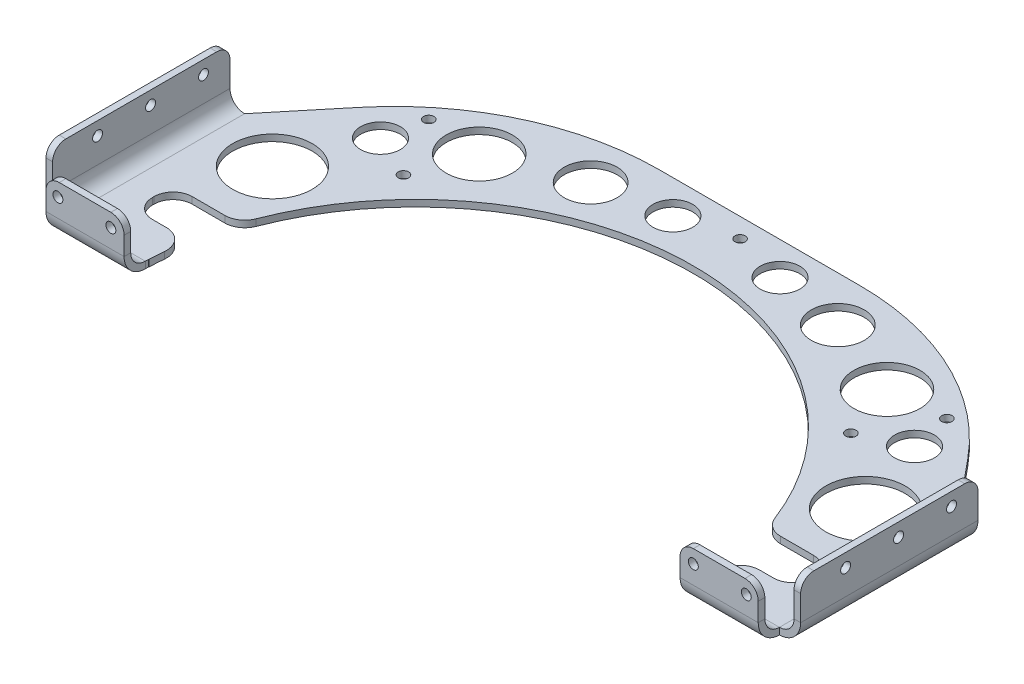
ISO-10303-21;
HEADER;
FILE_DESCRIPTION(('STEP AP214'),'2;1');
FILE_NAME('part.step','',(''),(''),'','','');
FILE_SCHEMA(('AUTOMOTIVE_DESIGN { 1 0 10303 214 1 1 1 1 }'));
ENDSEC;
DATA;
#1=APPLICATION_CONTEXT('core data for automotive mechanical design processes');
#2=APPLICATION_PROTOCOL_DEFINITION('international standard','automotive_design',2000,#1);
#3=PRODUCT_CONTEXT('',#1,'mechanical');
#4=PRODUCT('Part','Part','',(#3));
#5=PRODUCT_RELATED_PRODUCT_CATEGORY('part','',(#4));
#6=PRODUCT_DEFINITION_FORMATION('','',#4);
#7=PRODUCT_DEFINITION_CONTEXT('part definition',#1,'design');
#8=PRODUCT_DEFINITION('design','',#6,#7);
#9=PRODUCT_DEFINITION_SHAPE('','',#8);
#10=(LENGTH_UNIT() NAMED_UNIT(*) SI_UNIT(.MILLI.,.METRE.));
#11=(NAMED_UNIT(*) PLANE_ANGLE_UNIT() SI_UNIT($,.RADIAN.));
#12=(NAMED_UNIT(*) SI_UNIT($,.STERADIAN.) SOLID_ANGLE_UNIT());
#13=UNCERTAINTY_MEASURE_WITH_UNIT(LENGTH_MEASURE(1.E-05),#10,'distance_accuracy_value','');
#14=(GEOMETRIC_REPRESENTATION_CONTEXT(3) GLOBAL_UNCERTAINTY_ASSIGNED_CONTEXT((#13)) GLOBAL_UNIT_ASSIGNED_CONTEXT((#10,
#11,#12)) REPRESENTATION_CONTEXT('',''));
#15=CARTESIAN_POINT('',(0.,0.,0.));
#16=DIRECTION('',(0.,0.,1.));
#17=DIRECTION('',(1.,0.,0.));
#18=AXIS2_PLACEMENT_3D('',#15,#16,#17);
#19=CARTESIAN_POINT('',(0.,-3.175,0.));
#20=DIRECTION('',(0.,1.,0.));
#21=DIRECTION('',(0.,0.,1.));
#22=AXIS2_PLACEMENT_3D('',#19,#20,#21);
#23=CYLINDRICAL_SURFACE('',#22,133.35);
#24=CARTESIAN_POINT('',(0.,0.,0.));
#25=DIRECTION('',(0.,-1.,0.));
#26=DIRECTION('',(0.,0.,1.));
#27=AXIS2_PLACEMENT_3D('',#24,#25,#26);
#28=CIRCLE('',#27,133.35);
#29=CARTESIAN_POINT('',(132.766603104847,0.,-12.46));
#30=VERTEX_POINT('',#29);
#31=CARTESIAN_POINT('',(133.240111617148,0.,-5.41249999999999));
#32=VERTEX_POINT('',#31);
#33=EDGE_CURVE('E704',#30,#32,#28,.T.);
#34=ORIENTED_EDGE('',*,*,#33,.F.);
#35=DIRECTION('',(0.,1.,0.));
#36=VECTOR('',#35,1.);
#37=CARTESIAN_POINT('',(132.766603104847,-3.175,-12.46));
#38=LINE('',#37,#36);
#39=CARTESIAN_POINT('',(132.766603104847,-3.175,-12.46));
#40=VERTEX_POINT('',#39);
#41=EDGE_CURVE('E818',#30,#40,#38,.F.);
#42=ORIENTED_EDGE('',*,*,#41,.T.);
#43=CARTESIAN_POINT('',(0.,-3.175,0.));
#44=DIRECTION('',(0.,-1.,0.));
#45=DIRECTION('',(0.,0.,1.));
#46=AXIS2_PLACEMENT_3D('',#43,#44,#45);
#47=CIRCLE('',#46,133.35);
#48=CARTESIAN_POINT('',(133.240111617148,-3.175,-5.41249999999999));
#49=VERTEX_POINT('',#48);
#50=EDGE_CURVE('E711',#40,#49,#47,.T.);
#51=ORIENTED_EDGE('',*,*,#50,.T.);
#52=DIRECTION('',(0.,1.,0.));
#53=VECTOR('',#52,1.);
#54=CARTESIAN_POINT('',(133.240111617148,-3.175,-5.41249999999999));
#55=LINE('',#54,#53);
#56=EDGE_CURVE('E677',#49,#32,#55,.T.);
#57=ORIENTED_EDGE('',*,*,#56,.T.);
#58=EDGE_LOOP('',(#34,#42,#51,#57));
#59=FACE_BOUND('',#58,.T.);
#60=ADVANCED_FACE('F130',(#59),#23,.F.);
#61=CARTESIAN_POINT('',(-124.403786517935,0.,-48.02));
#62=VERTEX_POINT('',#61);
#63=CARTESIAN_POINT('',(124.403786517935,0.,-48.02));
#64=VERTEX_POINT('',#63);
#65=EDGE_CURVE('E729',#62,#64,#28,.T.);
#66=ORIENTED_EDGE('',*,*,#65,.F.);
#67=DIRECTION('',(0.,1.,0.));
#68=VECTOR('',#67,1.);
#69=CARTESIAN_POINT('',(-124.403786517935,-3.175,-48.02));
#70=LINE('',#69,#68);
#71=CARTESIAN_POINT('',(-124.403786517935,-3.175,-48.02));
#72=VERTEX_POINT('',#71);
#73=EDGE_CURVE('E800',#62,#72,#70,.F.);
#74=ORIENTED_EDGE('',*,*,#73,.T.);
#75=CARTESIAN_POINT('',(124.403786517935,-3.175,-48.02));
#76=VERTEX_POINT('',#75);
#77=EDGE_CURVE('E710',#72,#76,#47,.T.);
#78=ORIENTED_EDGE('',*,*,#77,.T.);
#79=DIRECTION('',(0.,1.,0.));
#80=VECTOR('',#79,1.);
#81=CARTESIAN_POINT('',(124.403786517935,-3.175,-48.02));
#82=LINE('',#81,#80);
#83=EDGE_CURVE('E798',#76,#64,#82,.T.);
#84=ORIENTED_EDGE('',*,*,#83,.T.);
#85=EDGE_LOOP('',(#66,#74,#78,#84));
#86=FACE_BOUND('',#85,.T.);
#87=ADVANCED_FACE('F1016',(#86),#23,.F.);
#88=CARTESIAN_POINT('',(0.,-3.175,0.));
#89=DIRECTION('',(0.,1.,0.));
#90=DIRECTION('',(0.,0.,1.));
#91=AXIS2_PLACEMENT_3D('',#88,#89,#90);
#92=PLANE('',#91);
#93=CARTESIAN_POINT('',(124.268842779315,-3.175,-130.699819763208));
#94=DIRECTION('',(0.,-1.,0.));
#95=DIRECTION('',(0.,0.,1.));
#96=AXIS2_PLACEMENT_3D('',#93,#94,#95);
#97=CIRCLE('',#96,2.48920000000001);
#98=CARTESIAN_POINT('',(124.268842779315,-3.175,-128.210619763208));
#99=VERTEX_POINT('',#98);
#100=EDGE_CURVE('E2273',#99,#99,#97,.T.);
#101=ORIENTED_EDGE('',*,*,#100,.F.);
#102=EDGE_LOOP('',(#101));
#103=FACE_BOUND('',#102,.T.);
#104=CARTESIAN_POINT('',(-124.268842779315,-3.175,-130.699819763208));
#105=DIRECTION('',(0.,-1.,0.));
#106=DIRECTION('',(0.,0.,-1.));
#107=AXIS2_PLACEMENT_3D('',#104,#105,#106);
#108=CIRCLE('',#107,2.48920000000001);
#109=CARTESIAN_POINT('',(-124.268842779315,-3.175,-133.189019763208));
#110=VERTEX_POINT('',#109);
#111=EDGE_CURVE('E2267',#110,#110,#108,.T.);
#112=ORIENTED_EDGE('',*,*,#111,.F.);
#113=EDGE_LOOP('',(#112));
#114=FACE_BOUND('',#113,.T.);
#115=CARTESIAN_POINT('',(142.24,-3.175,-73.675));
#116=DIRECTION('',(0.,-1.,0.));
#117=DIRECTION('',(0.,0.,1.));
#118=AXIS2_PLACEMENT_3D('',#115,#116,#117);
#119=CIRCLE('',#118,19.05);
#120=CARTESIAN_POINT('',(142.24,-3.175,-54.6250000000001));
#121=VERTEX_POINT('',#120);
#122=EDGE_CURVE('E2261',#121,#121,#119,.T.);
#123=ORIENTED_EDGE('',*,*,#122,.F.);
#124=EDGE_LOOP('',(#123));
#125=FACE_BOUND('',#124,.T.);
#126=CARTESIAN_POINT('',(128.079391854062,-3.175,-111.362134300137));
#127=DIRECTION('',(0.,-1.,0.));
#128=DIRECTION('',(0.,0.,1.));
#129=AXIS2_PLACEMENT_3D('',#126,#127,#128);
#130=CIRCLE('',#129,9.52500000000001);
#131=CARTESIAN_POINT('',(128.079391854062,-3.175,-101.837134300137));
#132=VERTEX_POINT('',#131);
#133=EDGE_CURVE('E2255',#132,#132,#130,.T.);
#134=ORIENTED_EDGE('',*,*,#133,.F.);
#135=EDGE_LOOP('',(#134));
#136=FACE_BOUND('',#135,.T.);
#137=CARTESIAN_POINT('',(97.79,-3.175,-128.43874365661));
#138=DIRECTION('',(0.,-1.,0.));
#139=DIRECTION('',(0.,0.,1.));
#140=AXIS2_PLACEMENT_3D('',#137,#138,#139);
#141=CIRCLE('',#140,15.875);
#142=CARTESIAN_POINT('',(97.79,-3.175,-112.56374365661));
#143=VERTEX_POINT('',#142);
#144=EDGE_CURVE('E2249',#143,#143,#141,.T.);
#145=ORIENTED_EDGE('',*,*,#144,.F.);
#146=EDGE_LOOP('',(#145));
#147=FACE_BOUND('',#146,.T.);
#148=CARTESIAN_POINT('',(59.2662893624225,-3.175,-143.360181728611));
#149=DIRECTION('',(0.,-1.,0.));
#150=DIRECTION('',(0.,0.,1.));
#151=AXIS2_PLACEMENT_3D('',#148,#149,#150);
#152=CIRCLE('',#151,12.7);
#153=CARTESIAN_POINT('',(59.2662893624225,-3.175,-130.660181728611));
#154=VERTEX_POINT('',#153);
#155=EDGE_CURVE('E2243',#154,#154,#152,.T.);
#156=ORIENTED_EDGE('',*,*,#155,.F.);
#157=EDGE_LOOP('',(#156));
#158=FACE_BOUND('',#157,.T.);
#159=CARTESIAN_POINT('',(25.6930537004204,-3.175,-149.225));
#160=DIRECTION('',(0.,-1.,0.));
#161=DIRECTION('',(0.,0.,1.));
#162=AXIS2_PLACEMENT_3D('',#159,#160,#161);
#163=CIRCLE('',#162,9.525);
#164=CARTESIAN_POINT('',(25.6930537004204,-3.175,-139.7));
#165=VERTEX_POINT('',#164);
#166=EDGE_CURVE('E2237',#165,#165,#163,.T.);
#167=ORIENTED_EDGE('',*,*,#166,.F.);
#168=EDGE_LOOP('',(#167));
#169=FACE_BOUND('',#168,.T.);
#170=CARTESIAN_POINT('',(-128.079391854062,-3.175,-111.362134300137));
#171=DIRECTION('',(0.,-1.,0.));
#172=DIRECTION('',(0.,0.,-1.));
#173=AXIS2_PLACEMENT_3D('',#170,#171,#172);
#174=CIRCLE('',#173,9.52500000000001);
#175=CARTESIAN_POINT('',(-128.079391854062,-3.175,-120.887134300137));
#176=VERTEX_POINT('',#175);
#177=EDGE_CURVE('E2231',#176,#176,#174,.T.);
#178=ORIENTED_EDGE('',*,*,#177,.F.);
#179=EDGE_LOOP('',(#178));
#180=FACE_BOUND('',#179,.T.);
#181=CARTESIAN_POINT('',(-142.24,-3.175,-73.675));
#182=DIRECTION('',(0.,-1.,0.));
#183=DIRECTION('',(0.,0.,-1.));
#184=AXIS2_PLACEMENT_3D('',#181,#182,#183);
#185=CIRCLE('',#184,19.05);
#186=CARTESIAN_POINT('',(-142.24,-3.175,-92.725));
#187=VERTEX_POINT('',#186);
#188=EDGE_CURVE('E2225',#187,#187,#185,.T.);
#189=ORIENTED_EDGE('',*,*,#188,.F.);
#190=EDGE_LOOP('',(#189));
#191=FACE_BOUND('',#190,.T.);
#192=CARTESIAN_POINT('',(-97.79,-3.175,-128.43874365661));
#193=DIRECTION('',(0.,-1.,0.));
#194=DIRECTION('',(0.,0.,-1.));
#195=AXIS2_PLACEMENT_3D('',#192,#193,#194);
#196=CIRCLE('',#195,15.875);
#197=CARTESIAN_POINT('',(-97.79,-3.175,-144.31374365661));
#198=VERTEX_POINT('',#197);
#199=EDGE_CURVE('E2219',#198,#198,#196,.T.);
#200=ORIENTED_EDGE('',*,*,#199,.F.);
#201=EDGE_LOOP('',(#200));
#202=FACE_BOUND('',#201,.T.);
#203=CARTESIAN_POINT('',(-25.6930537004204,-3.175,-149.225));
#204=DIRECTION('',(0.,-1.,0.));
#205=DIRECTION('',(0.,0.,-1.));
#206=AXIS2_PLACEMENT_3D('',#203,#204,#205);
#207=CIRCLE('',#206,9.525);
#208=CARTESIAN_POINT('',(-25.6930537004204,-3.175,-158.75));
#209=VERTEX_POINT('',#208);
#210=EDGE_CURVE('E2213',#209,#209,#207,.T.);
#211=ORIENTED_EDGE('',*,*,#210,.F.);
#212=EDGE_LOOP('',(#211));
#213=FACE_BOUND('',#212,.T.);
#214=CARTESIAN_POINT('',(-59.2662893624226,-3.175,-143.360181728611));
#215=DIRECTION('',(0.,-1.,0.));
#216=DIRECTION('',(0.,0.,-1.));
#217=AXIS2_PLACEMENT_3D('',#214,#215,#216);
#218=CIRCLE('',#217,12.7);
#219=CARTESIAN_POINT('',(-59.2662893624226,-3.175,-156.060181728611));
#220=VERTEX_POINT('',#219);
#221=EDGE_CURVE('E2207',#220,#220,#218,.T.);
#222=ORIENTED_EDGE('',*,*,#221,.F.);
#223=EDGE_LOOP('',(#222));
#224=FACE_BOUND('',#223,.T.);
#225=CARTESIAN_POINT('',(0.,-3.175,-155.771113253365));
#226=DIRECTION('',(0.,-1.,0.));
#227=DIRECTION('',(0.,0.,-1.));
#228=AXIS2_PLACEMENT_3D('',#225,#226,#227);
#229=CIRCLE('',#228,2.48920000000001);
#230=CARTESIAN_POINT('',(0.,-3.175,-158.260313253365));
#231=VERTEX_POINT('',#230);
#232=EDGE_CURVE('E2201',#231,#231,#229,.T.);
#233=ORIENTED_EDGE('',*,*,#232,.F.);
#234=EDGE_LOOP('',(#233));
#235=FACE_BOUND('',#234,.T.);
#236=CARTESIAN_POINT('',(107.315,-3.175,-101.6));
#237=DIRECTION('',(0.,1.,0.));
#238=DIRECTION('',(0.,0.,1.));
#239=AXIS2_PLACEMENT_3D('',#236,#237,#238);
#240=CIRCLE('',#239,2.4892);
#241=CARTESIAN_POINT('',(107.315,-3.175,-99.1108));
#242=VERTEX_POINT('',#241);
#243=EDGE_CURVE('E695',#242,#242,#240,.T.);
#244=ORIENTED_EDGE('',*,*,#243,.T.);
#245=EDGE_LOOP('',(#244));
#246=FACE_BOUND('',#245,.T.);
#247=CARTESIAN_POINT('',(-107.315,-3.175,-101.6));
#248=DIRECTION('',(0.,1.,0.));
#249=DIRECTION('',(0.,0.,1.));
#250=AXIS2_PLACEMENT_3D('',#247,#248,#249);
#251=CIRCLE('',#250,2.4892);
#252=CARTESIAN_POINT('',(-107.315,-3.175,-99.1108));
#253=VERTEX_POINT('',#252);
#254=EDGE_CURVE('E701',#253,#253,#251,.T.);
#255=ORIENTED_EDGE('',*,*,#254,.T.);
#256=EDGE_LOOP('',(#255));
#257=FACE_BOUND('',#256,.T.);
#258=DIRECTION('',(-0.636382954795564,0.,0.771373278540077));
#259=VECTOR('',#258,1.);
#260=CARTESIAN_POINT('',(-170.815,-3.175,-88.9));
#261=LINE('',#260,#259);
#262=CARTESIAN_POINT('',(-146.047975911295,-3.175,-118.920635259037));
#263=VERTEX_POINT('',#262);
#264=CARTESIAN_POINT('',(-170.815,-3.175,-88.9));
#265=VERTEX_POINT('',#264);
#266=EDGE_CURVE('E719',#263,#265,#261,.T.);
#267=ORIENTED_EDGE('',*,*,#266,.F.);
#268=CARTESIAN_POINT('',(-48.083569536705,-3.175,-38.1));
#269=DIRECTION('',(0.,1.,0.));
#270=DIRECTION('',(0.,0.,1.));
#271=AXIS2_PLACEMENT_3D('',#268,#269,#270);
#272=CIRCLE('',#271,127.);
#273=CARTESIAN_POINT('',(-48.083569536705,-3.175,-165.1));
#274=VERTEX_POINT('',#273);
#275=EDGE_CURVE('E851',#263,#274,#272,.F.);
#276=ORIENTED_EDGE('',*,*,#275,.T.);
#277=DIRECTION('',(-1.,0.,0.));
#278=VECTOR('',#277,1.);
#279=CARTESIAN_POINT('',(-107.95,-3.175,-165.1));
#280=LINE('',#279,#278);
#281=CARTESIAN_POINT('',(48.083569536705,-3.175,-165.1));
#282=VERTEX_POINT('',#281);
#283=EDGE_CURVE('E716',#282,#274,#280,.T.);
#284=ORIENTED_EDGE('',*,*,#283,.F.);
#285=CARTESIAN_POINT('',(48.083569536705,-3.175,-38.1));
#286=DIRECTION('',(0.,1.,0.));
#287=DIRECTION('',(0.,0.,1.));
#288=AXIS2_PLACEMENT_3D('',#285,#286,#287);
#289=CIRCLE('',#288,127.);
#290=CARTESIAN_POINT('',(146.047975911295,-3.175,-118.920635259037));
#291=VERTEX_POINT('',#290);
#292=EDGE_CURVE('E849',#282,#291,#289,.F.);
#293=ORIENTED_EDGE('',*,*,#292,.T.);
#294=DIRECTION('',(-0.636382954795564,0.,-0.771373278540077));
#295=VECTOR('',#294,1.);
#296=CARTESIAN_POINT('',(107.95,-3.175,-165.1));
#297=LINE('',#296,#295);
#298=CARTESIAN_POINT('',(170.815,-3.17500000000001,-88.8999999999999));
#299=VERTEX_POINT('',#298);
#300=EDGE_CURVE('E713',#299,#291,#297,.T.);
#301=ORIENTED_EDGE('',*,*,#300,.F.);
#302=DIRECTION('',(0.,0.,-1.));
#303=VECTOR('',#302,1.);
#304=CARTESIAN_POINT('',(170.815,-3.175,-88.9));
#305=LINE('',#304,#303);
#306=CARTESIAN_POINT('',(170.815,-3.17500000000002,-3.82499999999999));
#307=VERTEX_POINT('',#306);
#308=EDGE_CURVE('E481',#307,#299,#305,.T.);
#309=ORIENTED_EDGE('',*,*,#308,.F.);
#310=DIRECTION('',(1.,0.,0.));
#311=VECTOR('',#310,1.);
#312=CARTESIAN_POINT('',(170.815,-3.17500000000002,-3.82499999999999));
#313=LINE('',#312,#311);
#314=CARTESIAN_POINT('',(133.35,-3.175,-3.82499999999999));
#315=VERTEX_POINT('',#314);
#316=EDGE_CURVE('E592',#307,#315,#313,.F.);
#317=ORIENTED_EDGE('',*,*,#316,.T.);
#318=DIRECTION('',(0.,0.,1.));
#319=VECTOR('',#318,1.);
#320=CARTESIAN_POINT('',(133.35,-3.175,0.));
#321=LINE('',#320,#319);
#322=CARTESIAN_POINT('',(133.35,-3.175,-5.41249999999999));
#323=VERTEX_POINT('',#322);
#324=EDGE_CURVE('E680',#323,#315,#321,.T.);
#325=ORIENTED_EDGE('',*,*,#324,.F.);
#326=DIRECTION('',(1.,0.,0.));
#327=VECTOR('',#326,1.);
#328=CARTESIAN_POINT('',(0.,-3.175,-5.41249999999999));
#329=LINE('',#328,#327);
#330=EDGE_CURVE('E670',#49,#323,#329,.T.);
#331=ORIENTED_EDGE('',*,*,#330,.F.);
#332=ORIENTED_EDGE('',*,*,#50,.F.);
#333=CARTESIAN_POINT('',(142.249931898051,-3.175,-13.35));
#334=DIRECTION('',(0.,1.,0.));
#335=DIRECTION('',(0.,0.,1.));
#336=AXIS2_PLACEMENT_3D('',#333,#334,#335);
#337=CIRCLE('',#336,9.525);
#338=CARTESIAN_POINT('',(142.249931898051,-3.175,-22.875));
#339=VERTEX_POINT('',#338);
#340=EDGE_CURVE('E802',#40,#339,#337,.F.);
#341=ORIENTED_EDGE('',*,*,#340,.T.);
#342=DIRECTION('',(1.,0.,0.));
#343=VECTOR('',#342,1.);
#344=CARTESIAN_POINT('',(0.,-3.175,-22.875));
#345=LINE('',#344,#343);
#346=CARTESIAN_POINT('',(148.971,-3.175,-22.875));
#347=VERTEX_POINT('',#346);
#348=EDGE_CURVE('E1055',#339,#347,#345,.T.);
#349=ORIENTED_EDGE('',*,*,#348,.T.);
#350=CARTESIAN_POINT('',(148.971,-3.175,-32.019));
#351=DIRECTION('',(0.,1.,0.));
#352=DIRECTION('',(0.,0.,1.));
#353=AXIS2_PLACEMENT_3D('',#350,#351,#352);
#354=CIRCLE('',#353,9.144);
#355=CARTESIAN_POINT('',(158.115,-3.175,-32.019));
#356=VERTEX_POINT('',#355);
#357=EDGE_CURVE('E782',#347,#356,#354,.T.);
#358=ORIENTED_EDGE('',*,*,#357,.T.);
#359=DIRECTION('',(0.,0.,1.));
#360=VECTOR('',#359,1.);
#361=CARTESIAN_POINT('',(158.115,-3.175,0.));
#362=LINE('',#361,#360);
#363=CARTESIAN_POINT('',(158.115,-3.175,-32.781));
#364=VERTEX_POINT('',#363);
#365=EDGE_CURVE('E1036',#356,#364,#362,.F.);
#366=ORIENTED_EDGE('',*,*,#365,.T.);
#367=CARTESIAN_POINT('',(148.971,-3.175,-32.781));
#368=DIRECTION('',(0.,1.,0.));
#369=DIRECTION('',(0.,0.,1.));
#370=AXIS2_PLACEMENT_3D('',#367,#368,#369);
#371=CIRCLE('',#370,9.144);
#372=CARTESIAN_POINT('',(148.971,-3.175,-41.925));
#373=VERTEX_POINT('',#372);
#374=EDGE_CURVE('E778',#364,#373,#371,.T.);
#375=ORIENTED_EDGE('',*,*,#374,.T.);
#376=DIRECTION('',(1.,0.,0.));
#377=VECTOR('',#376,1.);
#378=CARTESIAN_POINT('',(0.,-3.175,-41.925));
#379=LINE('',#378,#377);
#380=CARTESIAN_POINT('',(133.289771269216,-3.175,-41.925));
#381=VERTEX_POINT('',#380);
#382=EDGE_CURVE('E2151',#373,#381,#379,.F.);
#383=ORIENTED_EDGE('',*,*,#382,.T.);
#384=CARTESIAN_POINT('',(133.289771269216,-3.175,-51.45));
#385=DIRECTION('',(0.,1.,0.));
#386=DIRECTION('',(0.,0.,1.));
#387=AXIS2_PLACEMENT_3D('',#384,#385,#386);
#388=CIRCLE('',#387,9.525);
#389=EDGE_CURVE('E804',#381,#76,#388,.F.);
#390=ORIENTED_EDGE('',*,*,#389,.T.);
#391=ORIENTED_EDGE('',*,*,#77,.F.);
#392=CARTESIAN_POINT('',(-133.289771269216,-3.175,-51.45));
#393=DIRECTION('',(0.,1.,0.));
#394=DIRECTION('',(0.,0.,1.));
#395=AXIS2_PLACEMENT_3D('',#392,#393,#394);
#396=CIRCLE('',#395,9.525);
#397=CARTESIAN_POINT('',(-133.289771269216,-3.175,-41.925));
#398=VERTEX_POINT('',#397);
#399=EDGE_CURVE('E808',#72,#398,#396,.F.);
#400=ORIENTED_EDGE('',*,*,#399,.T.);
#401=DIRECTION('',(-1.,0.,0.));
#402=VECTOR('',#401,1.);
#403=CARTESIAN_POINT('',(-120.015,-3.175,-41.925));
#404=LINE('',#403,#402);
#405=CARTESIAN_POINT('',(-148.971,-3.175,-41.925));
#406=VERTEX_POINT('',#405);
#407=EDGE_CURVE('E1047',#398,#406,#404,.T.);
#408=ORIENTED_EDGE('',*,*,#407,.T.);
#409=CARTESIAN_POINT('',(-148.971,-3.175,-32.781));
#410=DIRECTION('',(0.,1.,0.));
#411=DIRECTION('',(0.,0.,1.));
#412=AXIS2_PLACEMENT_3D('',#409,#410,#411);
#413=CIRCLE('',#412,9.144);
#414=CARTESIAN_POINT('',(-158.115,-3.175,-32.781));
#415=VERTEX_POINT('',#414);
#416=EDGE_CURVE('E772',#406,#415,#413,.T.);
#417=ORIENTED_EDGE('',*,*,#416,.T.);
#418=DIRECTION('',(0.,0.,1.));
#419=VECTOR('',#418,1.);
#420=CARTESIAN_POINT('',(-158.115,-3.175,-22.875));
#421=LINE('',#420,#419);
#422=CARTESIAN_POINT('',(-158.115,-3.175,-32.019));
#423=VERTEX_POINT('',#422);
#424=EDGE_CURVE('E1054',#415,#423,#421,.T.);
#425=ORIENTED_EDGE('',*,*,#424,.T.);
#426=CARTESIAN_POINT('',(-148.971,-3.175,-32.019));
#427=DIRECTION('',(0.,1.,0.));
#428=DIRECTION('',(0.,0.,1.));
#429=AXIS2_PLACEMENT_3D('',#426,#427,#428);
#430=CIRCLE('',#429,9.144);
#431=CARTESIAN_POINT('',(-148.971,-3.175,-22.875));
#432=VERTEX_POINT('',#431);
#433=EDGE_CURVE('E776',#423,#432,#430,.T.);
#434=ORIENTED_EDGE('',*,*,#433,.T.);
#435=DIRECTION('',(1.,0.,0.));
#436=VECTOR('',#435,1.);
#437=CARTESIAN_POINT('',(-120.015,-3.175,-22.875));
#438=LINE('',#437,#436);
#439=CARTESIAN_POINT('',(-142.249931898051,-3.175,-22.875));
#440=VERTEX_POINT('',#439);
#441=EDGE_CURVE('E1051',#432,#440,#438,.T.);
#442=ORIENTED_EDGE('',*,*,#441,.T.);
#443=CARTESIAN_POINT('',(-142.249931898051,-3.175,-13.35));
#444=DIRECTION('',(0.,1.,0.));
#445=DIRECTION('',(0.,0.,1.));
#446=AXIS2_PLACEMENT_3D('',#443,#444,#445);
#447=CIRCLE('',#446,9.525);
#448=CARTESIAN_POINT('',(-132.766603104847,-3.175,-12.46));
#449=VERTEX_POINT('',#448);
#450=EDGE_CURVE('E806',#440,#449,#447,.F.);
#451=ORIENTED_EDGE('',*,*,#450,.T.);
#452=CARTESIAN_POINT('',(-133.240111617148,-3.175,-5.41249999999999));
#453=VERTEX_POINT('',#452);
#454=EDGE_CURVE('E707',#453,#449,#47,.T.);
#455=ORIENTED_EDGE('',*,*,#454,.F.);
#456=DIRECTION('',(1.,0.,0.));
#457=VECTOR('',#456,1.);
#458=CARTESIAN_POINT('',(0.,-3.175,-5.41249999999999));
#459=LINE('',#458,#457);
#460=CARTESIAN_POINT('',(-133.35,-3.175,-5.41249999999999));
#461=VERTEX_POINT('',#460);
#462=EDGE_CURVE('E689',#461,#453,#459,.T.);
#463=ORIENTED_EDGE('',*,*,#462,.F.);
#464=DIRECTION('',(0.,0.,-1.));
#465=VECTOR('',#464,1.);
#466=CARTESIAN_POINT('',(-133.35,-3.175,0.));
#467=LINE('',#466,#465);
#468=CARTESIAN_POINT('',(-133.35,-3.17500000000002,-3.82499999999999));
#469=VERTEX_POINT('',#468);
#470=EDGE_CURVE('E685',#469,#461,#467,.T.);
#471=ORIENTED_EDGE('',*,*,#470,.F.);
#472=DIRECTION('',(1.,0.,0.));
#473=VECTOR('',#472,1.);
#474=CARTESIAN_POINT('',(-133.35,-3.17500000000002,-3.82499999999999));
#475=LINE('',#474,#473);
#476=CARTESIAN_POINT('',(-170.815,-3.17500000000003,-3.825));
#477=VERTEX_POINT('',#476);
#478=EDGE_CURVE('E643',#469,#477,#475,.F.);
#479=ORIENTED_EDGE('',*,*,#478,.T.);
#480=DIRECTION('',(0.,0.,1.));
#481=VECTOR('',#480,1.);
#482=CARTESIAN_POINT('',(-170.815,-3.175,6.35));
#483=LINE('',#482,#481);
#484=EDGE_CURVE('E721',#265,#477,#483,.T.);
#485=ORIENTED_EDGE('',*,*,#484,.F.);
#486=EDGE_LOOP('',(#267,#276,#284,#293,#301,#309,#317,#325,#331,#332,#341,#349,#358,#366,#375,
#383,#390,#391,#400,#408,#417,#425,#434,#442,#451,#455,#463,#471,#479,#485));
#487=FACE_BOUND('',#486,.T.);
#488=ADVANCED_FACE('F989',(#103,#114,#125,#136,#147,#158,#169,#180,#191,#202,#213,#224,#235,
#246,#257,#487),#92,.F.);
#489=CARTESIAN_POINT('',(0.,0.,0.));
#490=DIRECTION('',(0.,1.,0.));
#491=DIRECTION('',(0.,0.,1.));
#492=AXIS2_PLACEMENT_3D('',#489,#490,#491);
#493=PLANE('',#492);
#494=CARTESIAN_POINT('',(124.268842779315,0.,-130.699819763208));
#495=DIRECTION('',(0.,-1.,0.));
#496=DIRECTION('',(0.,0.,1.));
#497=AXIS2_PLACEMENT_3D('',#494,#495,#496);
#498=CIRCLE('',#497,2.48920000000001);
#499=CARTESIAN_POINT('',(124.268842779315,0.,-128.210619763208));
#500=VERTEX_POINT('',#499);
#501=EDGE_CURVE('E2270',#500,#500,#498,.T.);
#502=ORIENTED_EDGE('',*,*,#501,.T.);
#503=EDGE_LOOP('',(#502));
#504=FACE_BOUND('',#503,.T.);
#505=CARTESIAN_POINT('',(-124.268842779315,0.,-130.699819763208));
#506=DIRECTION('',(0.,-1.,0.));
#507=DIRECTION('',(0.,0.,-1.));
#508=AXIS2_PLACEMENT_3D('',#505,#506,#507);
#509=CIRCLE('',#508,2.48920000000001);
#510=CARTESIAN_POINT('',(-124.268842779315,0.,-133.189019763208));
#511=VERTEX_POINT('',#510);
#512=EDGE_CURVE('E2264',#511,#511,#509,.T.);
#513=ORIENTED_EDGE('',*,*,#512,.T.);
#514=EDGE_LOOP('',(#513));
#515=FACE_BOUND('',#514,.T.);
#516=CARTESIAN_POINT('',(142.24,0.,-73.675));
#517=DIRECTION('',(0.,-1.,0.));
#518=DIRECTION('',(0.,0.,1.));
#519=AXIS2_PLACEMENT_3D('',#516,#517,#518);
#520=CIRCLE('',#519,19.05);
#521=CARTESIAN_POINT('',(142.24,0.,-54.6250000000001));
#522=VERTEX_POINT('',#521);
#523=EDGE_CURVE('E2258',#522,#522,#520,.T.);
#524=ORIENTED_EDGE('',*,*,#523,.T.);
#525=EDGE_LOOP('',(#524));
#526=FACE_BOUND('',#525,.T.);
#527=CARTESIAN_POINT('',(128.079391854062,0.,-111.362134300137));
#528=DIRECTION('',(0.,-1.,0.));
#529=DIRECTION('',(0.,0.,1.));
#530=AXIS2_PLACEMENT_3D('',#527,#528,#529);
#531=CIRCLE('',#530,9.52500000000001);
#532=CARTESIAN_POINT('',(128.079391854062,0.,-101.837134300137));
#533=VERTEX_POINT('',#532);
#534=EDGE_CURVE('E2252',#533,#533,#531,.T.);
#535=ORIENTED_EDGE('',*,*,#534,.T.);
#536=EDGE_LOOP('',(#535));
#537=FACE_BOUND('',#536,.T.);
#538=CARTESIAN_POINT('',(97.79,0.,-128.43874365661));
#539=DIRECTION('',(0.,-1.,0.));
#540=DIRECTION('',(0.,0.,1.));
#541=AXIS2_PLACEMENT_3D('',#538,#539,#540);
#542=CIRCLE('',#541,15.875);
#543=CARTESIAN_POINT('',(97.79,0.,-112.56374365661));
#544=VERTEX_POINT('',#543);
#545=EDGE_CURVE('E2246',#544,#544,#542,.T.);
#546=ORIENTED_EDGE('',*,*,#545,.T.);
#547=EDGE_LOOP('',(#546));
#548=FACE_BOUND('',#547,.T.);
#549=CARTESIAN_POINT('',(59.2662893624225,0.,-143.360181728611));
#550=DIRECTION('',(0.,-1.,0.));
#551=DIRECTION('',(0.,0.,1.));
#552=AXIS2_PLACEMENT_3D('',#549,#550,#551);
#553=CIRCLE('',#552,12.7);
#554=CARTESIAN_POINT('',(59.2662893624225,0.,-130.660181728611));
#555=VERTEX_POINT('',#554);
#556=EDGE_CURVE('E2240',#555,#555,#553,.T.);
#557=ORIENTED_EDGE('',*,*,#556,.T.);
#558=EDGE_LOOP('',(#557));
#559=FACE_BOUND('',#558,.T.);
#560=CARTESIAN_POINT('',(25.6930537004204,0.,-149.225));
#561=DIRECTION('',(0.,-1.,0.));
#562=DIRECTION('',(0.,0.,1.));
#563=AXIS2_PLACEMENT_3D('',#560,#561,#562);
#564=CIRCLE('',#563,9.525);
#565=CARTESIAN_POINT('',(25.6930537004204,0.,-139.7));
#566=VERTEX_POINT('',#565);
#567=EDGE_CURVE('E2234',#566,#566,#564,.T.);
#568=ORIENTED_EDGE('',*,*,#567,.T.);
#569=EDGE_LOOP('',(#568));
#570=FACE_BOUND('',#569,.T.);
#571=CARTESIAN_POINT('',(-128.079391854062,0.,-111.362134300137));
#572=DIRECTION('',(0.,-1.,0.));
#573=DIRECTION('',(0.,0.,-1.));
#574=AXIS2_PLACEMENT_3D('',#571,#572,#573);
#575=CIRCLE('',#574,9.52500000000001);
#576=CARTESIAN_POINT('',(-128.079391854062,0.,-120.887134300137));
#577=VERTEX_POINT('',#576);
#578=EDGE_CURVE('E2228',#577,#577,#575,.T.);
#579=ORIENTED_EDGE('',*,*,#578,.T.);
#580=EDGE_LOOP('',(#579));
#581=FACE_BOUND('',#580,.T.);
#582=CARTESIAN_POINT('',(-142.24,0.,-73.675));
#583=DIRECTION('',(0.,-1.,0.));
#584=DIRECTION('',(0.,0.,-1.));
#585=AXIS2_PLACEMENT_3D('',#582,#583,#584);
#586=CIRCLE('',#585,19.05);
#587=CARTESIAN_POINT('',(-142.24,0.,-92.725));
#588=VERTEX_POINT('',#587);
#589=EDGE_CURVE('E2222',#588,#588,#586,.T.);
#590=ORIENTED_EDGE('',*,*,#589,.T.);
#591=EDGE_LOOP('',(#590));
#592=FACE_BOUND('',#591,.T.);
#593=CARTESIAN_POINT('',(-97.79,0.,-128.43874365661));
#594=DIRECTION('',(0.,-1.,0.));
#595=DIRECTION('',(0.,0.,-1.));
#596=AXIS2_PLACEMENT_3D('',#593,#594,#595);
#597=CIRCLE('',#596,15.875);
#598=CARTESIAN_POINT('',(-97.79,0.,-144.31374365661));
#599=VERTEX_POINT('',#598);
#600=EDGE_CURVE('E2216',#599,#599,#597,.T.);
#601=ORIENTED_EDGE('',*,*,#600,.T.);
#602=EDGE_LOOP('',(#601));
#603=FACE_BOUND('',#602,.T.);
#604=CARTESIAN_POINT('',(-25.6930537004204,0.,-149.225));
#605=DIRECTION('',(0.,-1.,0.));
#606=DIRECTION('',(0.,0.,-1.));
#607=AXIS2_PLACEMENT_3D('',#604,#605,#606);
#608=CIRCLE('',#607,9.525);
#609=CARTESIAN_POINT('',(-25.6930537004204,0.,-158.75));
#610=VERTEX_POINT('',#609);
#611=EDGE_CURVE('E2210',#610,#610,#608,.T.);
#612=ORIENTED_EDGE('',*,*,#611,.T.);
#613=EDGE_LOOP('',(#612));
#614=FACE_BOUND('',#613,.T.);
#615=CARTESIAN_POINT('',(-59.2662893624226,0.,-143.360181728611));
#616=DIRECTION('',(0.,-1.,0.));
#617=DIRECTION('',(0.,0.,-1.));
#618=AXIS2_PLACEMENT_3D('',#615,#616,#617);
#619=CIRCLE('',#618,12.7);
#620=CARTESIAN_POINT('',(-59.2662893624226,0.,-156.060181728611));
#621=VERTEX_POINT('',#620);
#622=EDGE_CURVE('E2204',#621,#621,#619,.T.);
#623=ORIENTED_EDGE('',*,*,#622,.T.);
#624=EDGE_LOOP('',(#623));
#625=FACE_BOUND('',#624,.T.);
#626=CARTESIAN_POINT('',(0.,0.,-155.771113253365));
#627=DIRECTION('',(0.,-1.,0.));
#628=DIRECTION('',(0.,0.,-1.));
#629=AXIS2_PLACEMENT_3D('',#626,#627,#628);
#630=CIRCLE('',#629,2.48920000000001);
#631=CARTESIAN_POINT('',(0.,0.,-158.260313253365));
#632=VERTEX_POINT('',#631);
#633=EDGE_CURVE('E2200',#632,#632,#630,.T.);
#634=ORIENTED_EDGE('',*,*,#633,.T.);
#635=EDGE_LOOP('',(#634));
#636=FACE_BOUND('',#635,.T.);
#637=CARTESIAN_POINT('',(107.315,0.,-101.6));
#638=DIRECTION('',(0.,1.,0.));
#639=DIRECTION('',(0.,0.,1.));
#640=AXIS2_PLACEMENT_3D('',#637,#638,#639);
#641=CIRCLE('',#640,2.4892);
#642=CARTESIAN_POINT('',(107.315,0.,-99.1108));
#643=VERTEX_POINT('',#642);
#644=EDGE_CURVE('E694',#643,#643,#641,.T.);
#645=ORIENTED_EDGE('',*,*,#644,.F.);
#646=EDGE_LOOP('',(#645));
#647=FACE_BOUND('',#646,.T.);
#648=CARTESIAN_POINT('',(-107.315,0.,-101.6));
#649=DIRECTION('',(0.,1.,0.));
#650=DIRECTION('',(0.,0.,1.));
#651=AXIS2_PLACEMENT_3D('',#648,#649,#650);
#652=CIRCLE('',#651,2.4892);
#653=CARTESIAN_POINT('',(-107.315,0.,-99.1108));
#654=VERTEX_POINT('',#653);
#655=EDGE_CURVE('E698',#654,#654,#652,.T.);
#656=ORIENTED_EDGE('',*,*,#655,.F.);
#657=EDGE_LOOP('',(#656));
#658=FACE_BOUND('',#657,.T.);
#659=DIRECTION('',(-1.,0.,0.));
#660=VECTOR('',#659,1.);
#661=CARTESIAN_POINT('',(-107.95,0.,-165.1));
#662=LINE('',#661,#660);
#663=CARTESIAN_POINT('',(48.083569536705,0.,-165.1));
#664=VERTEX_POINT('',#663);
#665=CARTESIAN_POINT('',(-48.083569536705,0.,-165.1));
#666=VERTEX_POINT('',#665);
#667=EDGE_CURVE('E734',#664,#666,#662,.T.);
#668=ORIENTED_EDGE('',*,*,#667,.T.);
#669=CARTESIAN_POINT('',(-48.083569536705,0.,-38.1));
#670=DIRECTION('',(0.,1.,0.));
#671=DIRECTION('',(0.,0.,1.));
#672=AXIS2_PLACEMENT_3D('',#669,#670,#671);
#673=CIRCLE('',#672,127.);
#674=CARTESIAN_POINT('',(-146.047975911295,0.,-118.920635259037));
#675=VERTEX_POINT('',#674);
#676=EDGE_CURVE('E845',#666,#675,#673,.T.);
#677=ORIENTED_EDGE('',*,*,#676,.T.);
#678=DIRECTION('',(-0.636382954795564,0.,0.771373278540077));
#679=VECTOR('',#678,1.);
#680=CARTESIAN_POINT('',(-170.815,0.,-88.9));
#681=LINE('',#680,#679);
#682=CARTESIAN_POINT('',(-170.815,0.,-88.9));
#683=VERTEX_POINT('',#682);
#684=EDGE_CURVE('E737',#675,#683,#681,.T.);
#685=ORIENTED_EDGE('',*,*,#684,.T.);
#686=DIRECTION('',(0.,0.,1.));
#687=VECTOR('',#686,1.);
#688=CARTESIAN_POINT('',(-170.815,0.,6.35));
#689=LINE('',#688,#687);
#690=CARTESIAN_POINT('',(-170.815,0.,-3.82499999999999));
#691=VERTEX_POINT('',#690);
#692=EDGE_CURVE('E739',#683,#691,#689,.T.);
#693=ORIENTED_EDGE('',*,*,#692,.T.);
#694=DIRECTION('',(1.,0.,0.));
#695=VECTOR('',#694,1.);
#696=CARTESIAN_POINT('',(-133.35,0.,-3.82499999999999));
#697=LINE('',#696,#695);
#698=CARTESIAN_POINT('',(-133.35,0.,-3.82499999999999));
#699=VERTEX_POINT('',#698);
#700=EDGE_CURVE('E656',#699,#691,#697,.F.);
#701=ORIENTED_EDGE('',*,*,#700,.F.);
#702=DIRECTION('',(0.,0.,1.));
#703=VECTOR('',#702,1.);
#704=CARTESIAN_POINT('',(-133.35,0.,-5.41249999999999));
#705=LINE('',#704,#703);
#706=CARTESIAN_POINT('',(-133.35,0.,-5.41249999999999));
#707=VERTEX_POINT('',#706);
#708=EDGE_CURVE('E683',#707,#699,#705,.T.);
#709=ORIENTED_EDGE('',*,*,#708,.F.);
#710=DIRECTION('',(1.,0.,0.));
#711=VECTOR('',#710,1.);
#712=CARTESIAN_POINT('',(0.,0.,-5.41249999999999));
#713=LINE('',#712,#711);
#714=CARTESIAN_POINT('',(-133.240111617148,0.,-5.41249999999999));
#715=VERTEX_POINT('',#714);
#716=EDGE_CURVE('E744',#707,#715,#713,.T.);
#717=ORIENTED_EDGE('',*,*,#716,.T.);
#718=CARTESIAN_POINT('',(-132.766603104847,0.,-12.46));
#719=VERTEX_POINT('',#718);
#720=EDGE_CURVE('E725',#715,#719,#28,.T.);
#721=ORIENTED_EDGE('',*,*,#720,.T.);
#722=CARTESIAN_POINT('',(-142.249931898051,0.,-13.35));
#723=DIRECTION('',(0.,1.,0.));
#724=DIRECTION('',(0.,0.,1.));
#725=AXIS2_PLACEMENT_3D('',#722,#723,#724);
#726=CIRCLE('',#725,9.525);
#727=CARTESIAN_POINT('',(-142.249931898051,0.,-22.875));
#728=VERTEX_POINT('',#727);
#729=EDGE_CURVE('E794',#719,#728,#726,.T.);
#730=ORIENTED_EDGE('',*,*,#729,.T.);
#731=DIRECTION('',(1.,0.,0.));
#732=VECTOR('',#731,1.);
#733=CARTESIAN_POINT('',(0.,0.,-22.875));
#734=LINE('',#733,#732);
#735=CARTESIAN_POINT('',(-148.971,0.,-22.875));
#736=VERTEX_POINT('',#735);
#737=EDGE_CURVE('E1043',#736,#728,#734,.T.);
#738=ORIENTED_EDGE('',*,*,#737,.F.);
#739=CARTESIAN_POINT('',(-148.971,0.,-32.019));
#740=DIRECTION('',(0.,1.,0.));
#741=DIRECTION('',(0.,0.,1.));
#742=AXIS2_PLACEMENT_3D('',#739,#740,#741);
#743=CIRCLE('',#742,9.144);
#744=CARTESIAN_POINT('',(-158.115,0.,-32.019));
#745=VERTEX_POINT('',#744);
#746=EDGE_CURVE('E774',#736,#745,#743,.F.);
#747=ORIENTED_EDGE('',*,*,#746,.T.);
#748=DIRECTION('',(0.,0.,1.));
#749=VECTOR('',#748,1.);
#750=CARTESIAN_POINT('',(-158.115,0.,0.));
#751=LINE('',#750,#749);
#752=CARTESIAN_POINT('',(-158.115,0.,-32.781));
#753=VERTEX_POINT('',#752);
#754=EDGE_CURVE('E1046',#753,#745,#751,.T.);
#755=ORIENTED_EDGE('',*,*,#754,.F.);
#756=CARTESIAN_POINT('',(-148.971,0.,-32.781));
#757=DIRECTION('',(0.,1.,0.));
#758=DIRECTION('',(0.,0.,1.));
#759=AXIS2_PLACEMENT_3D('',#756,#757,#758);
#760=CIRCLE('',#759,9.144);
#761=CARTESIAN_POINT('',(-148.971,0.,-41.925));
#762=VERTEX_POINT('',#761);
#763=EDGE_CURVE('E769',#753,#762,#760,.F.);
#764=ORIENTED_EDGE('',*,*,#763,.T.);
#765=DIRECTION('',(1.,0.,0.));
#766=VECTOR('',#765,1.);
#767=CARTESIAN_POINT('',(0.,0.,-41.925));
#768=LINE('',#767,#766);
#769=CARTESIAN_POINT('',(-133.289771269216,0.,-41.925));
#770=VERTEX_POINT('',#769);
#771=EDGE_CURVE('E520',#770,#762,#768,.F.);
#772=ORIENTED_EDGE('',*,*,#771,.F.);
#773=CARTESIAN_POINT('',(-133.289771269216,0.,-51.45));
#774=DIRECTION('',(0.,1.,0.));
#775=DIRECTION('',(0.,0.,1.));
#776=AXIS2_PLACEMENT_3D('',#773,#774,#775);
#777=CIRCLE('',#776,9.525);
#778=EDGE_CURVE('E796',#770,#62,#777,.T.);
#779=ORIENTED_EDGE('',*,*,#778,.T.);
#780=ORIENTED_EDGE('',*,*,#65,.T.);
#781=CARTESIAN_POINT('',(133.289771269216,0.,-51.45));
#782=DIRECTION('',(0.,1.,0.));
#783=DIRECTION('',(0.,0.,1.));
#784=AXIS2_PLACEMENT_3D('',#781,#782,#783);
#785=CIRCLE('',#784,9.525);
#786=CARTESIAN_POINT('',(133.289771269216,0.,-41.925));
#787=VERTEX_POINT('',#786);
#788=EDGE_CURVE('E792',#64,#787,#785,.T.);
#789=ORIENTED_EDGE('',*,*,#788,.T.);
#790=DIRECTION('',(-1.,0.,0.));
#791=VECTOR('',#790,1.);
#792=CARTESIAN_POINT('',(120.015,0.,-41.925));
#793=LINE('',#792,#791);
#794=CARTESIAN_POINT('',(148.971,0.,-41.925));
#795=VERTEX_POINT('',#794);
#796=EDGE_CURVE('E1026',#795,#787,#793,.T.);
#797=ORIENTED_EDGE('',*,*,#796,.F.);
#798=CARTESIAN_POINT('',(148.971,0.,-32.781));
#799=DIRECTION('',(0.,1.,0.));
#800=DIRECTION('',(0.,0.,1.));
#801=AXIS2_PLACEMENT_3D('',#798,#799,#800);
#802=CIRCLE('',#801,9.144);
#803=CARTESIAN_POINT('',(158.115,0.,-32.781));
#804=VERTEX_POINT('',#803);
#805=EDGE_CURVE('E780',#795,#804,#802,.F.);
#806=ORIENTED_EDGE('',*,*,#805,.T.);
#807=DIRECTION('',(0.,0.,-1.));
#808=VECTOR('',#807,1.);
#809=CARTESIAN_POINT('',(158.115,0.,-22.875));
#810=LINE('',#809,#808);
#811=CARTESIAN_POINT('',(158.115,0.,-32.019));
#812=VERTEX_POINT('',#811);
#813=EDGE_CURVE('E1034',#812,#804,#810,.T.);
#814=ORIENTED_EDGE('',*,*,#813,.F.);
#815=CARTESIAN_POINT('',(148.971,0.,-32.019));
#816=DIRECTION('',(0.,1.,0.));
#817=DIRECTION('',(0.,0.,1.));
#818=AXIS2_PLACEMENT_3D('',#815,#816,#817);
#819=CIRCLE('',#818,9.144);
#820=CARTESIAN_POINT('',(148.971,0.,-22.875));
#821=VERTEX_POINT('',#820);
#822=EDGE_CURVE('E784',#812,#821,#819,.F.);
#823=ORIENTED_EDGE('',*,*,#822,.T.);
#824=DIRECTION('',(1.,0.,0.));
#825=VECTOR('',#824,1.);
#826=CARTESIAN_POINT('',(0.,0.,-22.875));
#827=LINE('',#826,#825);
#828=CARTESIAN_POINT('',(142.249931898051,0.,-22.875));
#829=VERTEX_POINT('',#828);
#830=EDGE_CURVE('E1033',#829,#821,#827,.T.);
#831=ORIENTED_EDGE('',*,*,#830,.F.);
#832=CARTESIAN_POINT('',(142.249931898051,0.,-13.35));
#833=DIRECTION('',(0.,1.,0.));
#834=DIRECTION('',(0.,0.,1.));
#835=AXIS2_PLACEMENT_3D('',#832,#833,#834);
#836=CIRCLE('',#835,9.525);
#837=EDGE_CURVE('E790',#829,#30,#836,.T.);
#838=ORIENTED_EDGE('',*,*,#837,.T.);
#839=ORIENTED_EDGE('',*,*,#33,.T.);
#840=DIRECTION('',(-1.,0.,0.));
#841=VECTOR('',#840,1.);
#842=CARTESIAN_POINT('',(133.35,0.,-5.41249999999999));
#843=LINE('',#842,#841);
#844=CARTESIAN_POINT('',(133.35,0.,-5.41249999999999));
#845=VERTEX_POINT('',#844);
#846=EDGE_CURVE('E671',#845,#32,#843,.T.);
#847=ORIENTED_EDGE('',*,*,#846,.F.);
#848=DIRECTION('',(0.,0.,-1.));
#849=VECTOR('',#848,1.);
#850=CARTESIAN_POINT('',(133.35,0.,-3.82499999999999));
#851=LINE('',#850,#849);
#852=CARTESIAN_POINT('',(133.35,0.,-3.82499999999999));
#853=VERTEX_POINT('',#852);
#854=EDGE_CURVE('E667',#853,#845,#851,.T.);
#855=ORIENTED_EDGE('',*,*,#854,.F.);
#856=DIRECTION('',(1.,0.,0.));
#857=VECTOR('',#856,1.);
#858=CARTESIAN_POINT('',(170.815,0.,-3.82499999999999));
#859=LINE('',#858,#857);
#860=CARTESIAN_POINT('',(170.815,0.,-3.82499999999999));
#861=VERTEX_POINT('',#860);
#862=EDGE_CURVE('E605',#861,#853,#859,.F.);
#863=ORIENTED_EDGE('',*,*,#862,.F.);
#864=DIRECTION('',(0.,0.,-1.));
#865=VECTOR('',#864,1.);
#866=CARTESIAN_POINT('',(170.815,0.,-88.9));
#867=LINE('',#866,#865);
#868=CARTESIAN_POINT('',(170.815,0.,-88.9));
#869=VERTEX_POINT('',#868);
#870=EDGE_CURVE('E728',#861,#869,#867,.T.);
#871=ORIENTED_EDGE('',*,*,#870,.T.);
#872=DIRECTION('',(-0.636382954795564,0.,-0.771373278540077));
#873=VECTOR('',#872,1.);
#874=CARTESIAN_POINT('',(107.95,0.,-165.1));
#875=LINE('',#874,#873);
#876=CARTESIAN_POINT('',(146.047975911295,0.,-118.920635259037));
#877=VERTEX_POINT('',#876);
#878=EDGE_CURVE('E731',#869,#877,#875,.T.);
#879=ORIENTED_EDGE('',*,*,#878,.T.);
#880=CARTESIAN_POINT('',(48.083569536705,0.,-38.1));
#881=DIRECTION('',(0.,1.,0.));
#882=DIRECTION('',(0.,0.,1.));
#883=AXIS2_PLACEMENT_3D('',#880,#881,#882);
#884=CIRCLE('',#883,127.);
#885=EDGE_CURVE('E843',#877,#664,#884,.T.);
#886=ORIENTED_EDGE('',*,*,#885,.T.);
#887=EDGE_LOOP('',(#668,#677,#685,#693,#701,#709,#717,#721,#730,#738,#747,#755,#764,#772,#779,
#780,#789,#797,#806,#814,#823,#831,#838,#839,#847,#855,#863,#871,#879,#886));
#888=FACE_BOUND('',#887,.T.);
#889=ADVANCED_FACE('F999',(#504,#515,#526,#537,#548,#559,#570,#581,#592,#603,#614,#625,#636,
#647,#658,#888),#493,.T.);
#890=ORIENTED_EDGE('',*,*,#454,.T.);
#891=DIRECTION('',(0.,1.,0.));
#892=VECTOR('',#891,1.);
#893=CARTESIAN_POINT('',(-132.766603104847,-3.175,-12.46));
#894=LINE('',#893,#892);
#895=EDGE_CURVE('E810',#449,#719,#894,.T.);
#896=ORIENTED_EDGE('',*,*,#895,.T.);
#897=ORIENTED_EDGE('',*,*,#720,.F.);
#898=DIRECTION('',(0.,1.,0.));
#899=VECTOR('',#898,1.);
#900=CARTESIAN_POINT('',(-133.240111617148,-3.175,-5.41249999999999));
#901=LINE('',#900,#899);
#902=EDGE_CURVE('E691',#715,#453,#901,.F.);
#903=ORIENTED_EDGE('',*,*,#902,.T.);
#904=EDGE_LOOP('',(#890,#896,#897,#903));
#905=FACE_BOUND('',#904,.T.);
#906=ADVANCED_FACE('F1088',(#905),#23,.F.);
#907=CARTESIAN_POINT('',(-170.815,-3.175,-88.9));
#908=DIRECTION('',(-0.771373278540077,0.,-0.636382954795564));
#909=DIRECTION('',(-0.636382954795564,0.,0.771373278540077));
#910=AXIS2_PLACEMENT_3D('',#907,#908,#909);
#911=PLANE('',#910);
#912=ORIENTED_EDGE('',*,*,#684,.F.);
#913=DIRECTION('',(0.,1.,0.));
#914=VECTOR('',#913,1.);
#915=CARTESIAN_POINT('',(-146.047975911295,-3.175,-118.920635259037));
#916=LINE('',#915,#914);
#917=EDGE_CURVE('E847',#675,#263,#916,.F.);
#918=ORIENTED_EDGE('',*,*,#917,.T.);
#919=ORIENTED_EDGE('',*,*,#266,.T.);
#920=DIRECTION('',(0.,1.,0.));
#921=VECTOR('',#920,1.);
#922=CARTESIAN_POINT('',(-170.815,-3.175,-88.9));
#923=LINE('',#922,#921);
#924=EDGE_CURVE('E741',#265,#683,#923,.T.);
#925=ORIENTED_EDGE('',*,*,#924,.T.);
#926=EDGE_LOOP('',(#912,#918,#919,#925));
#927=FACE_BOUND('',#926,.T.);
#928=ADVANCED_FACE('F1167',(#927),#911,.T.);
#929=CARTESIAN_POINT('',(-107.95,-3.175,-165.1));
#930=DIRECTION('',(0.,0.,-1.));
#931=DIRECTION('',(-1.,0.,0.));
#932=AXIS2_PLACEMENT_3D('',#929,#930,#931);
#933=PLANE('',#932);
#934=ORIENTED_EDGE('',*,*,#283,.T.);
#935=DIRECTION('',(0.,1.,0.));
#936=VECTOR('',#935,1.);
#937=CARTESIAN_POINT('',(-48.083569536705,-3.175,-165.1));
#938=LINE('',#937,#936);
#939=EDGE_CURVE('E840',#274,#666,#938,.T.);
#940=ORIENTED_EDGE('',*,*,#939,.T.);
#941=ORIENTED_EDGE('',*,*,#667,.F.);
#942=DIRECTION('',(0.,1.,0.));
#943=VECTOR('',#942,1.);
#944=CARTESIAN_POINT('',(48.083569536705,-3.175,-165.1));
#945=LINE('',#944,#943);
#946=EDGE_CURVE('E823',#664,#282,#945,.F.);
#947=ORIENTED_EDGE('',*,*,#946,.T.);
#948=EDGE_LOOP('',(#934,#940,#941,#947));
#949=FACE_BOUND('',#948,.T.);
#950=ADVANCED_FACE('F1172',(#949),#933,.T.);
#951=CARTESIAN_POINT('',(107.95,-3.175,-165.1));
#952=DIRECTION('',(0.771373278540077,0.,-0.636382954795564));
#953=DIRECTION('',(-0.636382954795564,0.,-0.771373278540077));
#954=AXIS2_PLACEMENT_3D('',#951,#952,#953);
#955=PLANE('',#954);
#956=ORIENTED_EDGE('',*,*,#300,.T.);
#957=DIRECTION('',(0.,1.,0.));
#958=VECTOR('',#957,1.);
#959=CARTESIAN_POINT('',(146.047975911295,-3.175,-118.920635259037));
#960=LINE('',#959,#958);
#961=EDGE_CURVE('E853',#291,#877,#960,.T.);
#962=ORIENTED_EDGE('',*,*,#961,.T.);
#963=ORIENTED_EDGE('',*,*,#878,.F.);
#964=DIRECTION('',(0.,1.,0.));
#965=VECTOR('',#964,1.);
#966=CARTESIAN_POINT('',(170.815,-3.175,-88.9));
#967=LINE('',#966,#965);
#968=EDGE_CURVE('E724',#299,#869,#967,.T.);
#969=ORIENTED_EDGE('',*,*,#968,.F.);
#970=EDGE_LOOP('',(#956,#962,#963,#969));
#971=FACE_BOUND('',#970,.T.);
#972=ADVANCED_FACE('F997',(#971),#955,.T.);
#973=CARTESIAN_POINT('',(-107.315,-3.175,-101.6));
#974=DIRECTION('',(0.,1.,0.));
#975=DIRECTION('',(0.,0.,1.));
#976=AXIS2_PLACEMENT_3D('',#973,#974,#975);
#977=CYLINDRICAL_SURFACE('',#976,2.4892);
#978=ORIENTED_EDGE('',*,*,#254,.F.);
#979=EDGE_LOOP('',(#978));
#980=FACE_BOUND('',#979,.T.);
#981=ORIENTED_EDGE('',*,*,#655,.T.);
#982=EDGE_LOOP('',(#981));
#983=FACE_BOUND('',#982,.T.);
#984=ADVANCED_FACE('F1189',(#980,#983),#977,.F.);
#985=CARTESIAN_POINT('',(107.315,-3.175,-101.6));
#986=DIRECTION('',(0.,1.,0.));
#987=DIRECTION('',(0.,0.,1.));
#988=AXIS2_PLACEMENT_3D('',#985,#986,#987);
#989=CYLINDRICAL_SURFACE('',#988,2.4892);
#990=ORIENTED_EDGE('',*,*,#243,.F.);
#991=EDGE_LOOP('',(#990));
#992=FACE_BOUND('',#991,.T.);
#993=ORIENTED_EDGE('',*,*,#644,.T.);
#994=EDGE_LOOP('',(#993));
#995=FACE_BOUND('',#994,.T.);
#996=ADVANCED_FACE('F1193',(#992,#995),#989,.F.);
#997=CARTESIAN_POINT('',(-133.35,0.,-5.41249999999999));
#998=DIRECTION('',(1.,0.,0.));
#999=DIRECTION('',(0.,0.,-1.));
#1000=AXIS2_PLACEMENT_3D('',#997,#998,#999);
#1001=PLANE('',#1000);
#1002=DIRECTION('',(0.,-1.,0.));
#1003=VECTOR('',#1002,1.);
#1004=CARTESIAN_POINT('',(-133.35,0.,-3.82499999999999));
#1005=LINE('',#1004,#1003);
#1006=EDGE_CURVE('E650',#699,#469,#1005,.T.);
#1007=ORIENTED_EDGE('',*,*,#1006,.T.);
#1008=ORIENTED_EDGE('',*,*,#470,.T.);
#1009=DIRECTION('',(0.,-1.,0.));
#1010=VECTOR('',#1009,1.);
#1011=CARTESIAN_POINT('',(-133.35,0.,-5.41249999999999));
#1012=LINE('',#1011,#1010);
#1013=EDGE_CURVE('E682',#707,#461,#1012,.T.);
#1014=ORIENTED_EDGE('',*,*,#1013,.F.);
#1015=ORIENTED_EDGE('',*,*,#708,.T.);
#1016=EDGE_LOOP('',(#1007,#1008,#1014,#1015));
#1017=FACE_BOUND('',#1016,.T.);
#1018=ADVANCED_FACE('F1096',(#1017),#1001,.T.);
#1019=CARTESIAN_POINT('',(-131.7625,0.,-5.41249999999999));
#1020=DIRECTION('',(0.,0.,1.));
#1021=DIRECTION('',(0.,-1.,0.));
#1022=AXIS2_PLACEMENT_3D('',#1019,#1020,#1021);
#1023=PLANE('',#1022);
#1024=ORIENTED_EDGE('',*,*,#902,.F.);
#1025=ORIENTED_EDGE('',*,*,#716,.F.);
#1026=ORIENTED_EDGE('',*,*,#1013,.T.);
#1027=ORIENTED_EDGE('',*,*,#462,.T.);
#1028=EDGE_LOOP('',(#1024,#1025,#1026,#1027));
#1029=FACE_BOUND('',#1028,.T.);
#1030=ADVANCED_FACE('F1093',(#1029),#1023,.T.);
#1031=CARTESIAN_POINT('',(133.35,0.,-3.82499999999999));
#1032=DIRECTION('',(-1.,0.,0.));
#1033=DIRECTION('',(0.,0.,1.));
#1034=AXIS2_PLACEMENT_3D('',#1031,#1032,#1033);
#1035=PLANE('',#1034);
#1036=DIRECTION('',(0.,-1.,0.));
#1037=VECTOR('',#1036,1.);
#1038=CARTESIAN_POINT('',(133.35,0.,-5.41249999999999));
#1039=LINE('',#1038,#1037);
#1040=EDGE_CURVE('E664',#845,#323,#1039,.T.);
#1041=ORIENTED_EDGE('',*,*,#1040,.T.);
#1042=ORIENTED_EDGE('',*,*,#324,.T.);
#1043=DIRECTION('',(0.,-1.,0.));
#1044=VECTOR('',#1043,1.);
#1045=CARTESIAN_POINT('',(133.35,0.,-3.82499999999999));
#1046=LINE('',#1045,#1044);
#1047=EDGE_CURVE('E610',#853,#315,#1046,.T.);
#1048=ORIENTED_EDGE('',*,*,#1047,.F.);
#1049=ORIENTED_EDGE('',*,*,#854,.T.);
#1050=EDGE_LOOP('',(#1041,#1042,#1048,#1049));
#1051=FACE_BOUND('',#1050,.T.);
#1052=ADVANCED_FACE('F1004',(#1051),#1035,.T.);
#1053=CARTESIAN_POINT('',(133.35,0.,-5.41249999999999));
#1054=DIRECTION('',(0.,0.,1.));
#1055=DIRECTION('',(0.,-1.,0.));
#1056=AXIS2_PLACEMENT_3D('',#1053,#1054,#1055);
#1057=PLANE('',#1056);
#1058=ORIENTED_EDGE('',*,*,#56,.F.);
#1059=ORIENTED_EDGE('',*,*,#330,.T.);
#1060=ORIENTED_EDGE('',*,*,#1040,.F.);
#1061=ORIENTED_EDGE('',*,*,#846,.T.);
#1062=EDGE_LOOP('',(#1058,#1059,#1060,#1061));
#1063=FACE_BOUND('',#1062,.T.);
#1064=ADVANCED_FACE('F1007',(#1063),#1057,.T.);
#1065=CARTESIAN_POINT('',(-170.815,6.99999999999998,-3.82499999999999));
#1066=DIRECTION('',(-1.,0.,0.));
#1067=DIRECTION('',(0.,0.,1.));
#1068=AXIS2_PLACEMENT_3D('',#1065,#1066,#1067);
#1069=PLANE('',#1068);
#1070=DIRECTION('',(0.,0.,-1.));
#1071=VECTOR('',#1070,1.);
#1072=CARTESIAN_POINT('',(-170.815,6.99999999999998,6.35000000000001));
#1073=LINE('',#1072,#1071);
#1074=CARTESIAN_POINT('',(-170.815,6.99999999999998,3.17500000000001));
#1075=VERTEX_POINT('',#1074);
#1076=CARTESIAN_POINT('',(-170.815,6.99999999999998,6.35000000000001));
#1077=VERTEX_POINT('',#1076);
#1078=EDGE_CURVE('E613',#1075,#1077,#1073,.F.);
#1079=ORIENTED_EDGE('',*,*,#1078,.F.);
#1080=CARTESIAN_POINT('',(-170.815,6.99999999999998,-3.82499999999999));
#1081=DIRECTION('',(1.,0.,0.));
#1082=DIRECTION('',(0.,0.,-1.));
#1083=AXIS2_PLACEMENT_3D('',#1080,#1081,#1082);
#1084=CIRCLE('',#1083,7.);
#1085=EDGE_CURVE('E653',#691,#1075,#1084,.F.);
#1086=ORIENTED_EDGE('',*,*,#1085,.F.);
#1087=DIRECTION('',(0.,-1.,0.));
#1088=VECTOR('',#1087,1.);
#1089=CARTESIAN_POINT('',(-170.815,0.,-3.82499999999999));
#1090=LINE('',#1089,#1088);
#1091=EDGE_CURVE('E661',#691,#477,#1090,.T.);
#1092=ORIENTED_EDGE('',*,*,#1091,.T.);
#1093=CARTESIAN_POINT('',(-170.815,6.99999999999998,-3.82499999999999));
#1094=DIRECTION('',(1.,0.,0.));
#1095=DIRECTION('',(0.,0.,-1.));
#1096=AXIS2_PLACEMENT_3D('',#1093,#1094,#1095);
#1097=CIRCLE('',#1096,10.175);
#1098=EDGE_CURVE('E646',#477,#1077,#1097,.F.);
#1099=ORIENTED_EDGE('',*,*,#1098,.T.);
#1100=EDGE_LOOP('',(#1079,#1086,#1092,#1099));
#1101=FACE_BOUND('',#1100,.T.);
#1102=ADVANCED_FACE('F1211',(#1101),#1069,.T.);
#1103=CARTESIAN_POINT('',(-133.35,6.99999999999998,-3.82499999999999));
#1104=DIRECTION('',(-1.,0.,0.));
#1105=DIRECTION('',(0.,0.,1.));
#1106=AXIS2_PLACEMENT_3D('',#1103,#1104,#1105);
#1107=PLANE('',#1106);
#1108=CARTESIAN_POINT('',(-133.35,6.99999999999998,-3.82499999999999));
#1109=DIRECTION('',(1.,0.,0.));
#1110=DIRECTION('',(0.,0.,-1.));
#1111=AXIS2_PLACEMENT_3D('',#1108,#1109,#1110);
#1112=CIRCLE('',#1111,7.);
#1113=CARTESIAN_POINT('',(-133.35,6.99999999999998,3.17500000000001));
#1114=VERTEX_POINT('',#1113);
#1115=EDGE_CURVE('E619',#1114,#699,#1112,.T.);
#1116=ORIENTED_EDGE('',*,*,#1115,.F.);
#1117=DIRECTION('',(0.,0.,-1.));
#1118=VECTOR('',#1117,1.);
#1119=CARTESIAN_POINT('',(-133.35,6.99999999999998,3.17500000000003));
#1120=LINE('',#1119,#1118);
#1121=CARTESIAN_POINT('',(-133.35,6.99999999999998,6.35000000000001));
#1122=VERTEX_POINT('',#1121);
#1123=EDGE_CURVE('E636',#1114,#1122,#1120,.F.);
#1124=ORIENTED_EDGE('',*,*,#1123,.T.);
#1125=CARTESIAN_POINT('',(-133.35,6.99999999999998,-3.82499999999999));
#1126=DIRECTION('',(1.,0.,0.));
#1127=DIRECTION('',(0.,0.,-1.));
#1128=AXIS2_PLACEMENT_3D('',#1125,#1126,#1127);
#1129=CIRCLE('',#1128,10.175);
#1130=EDGE_CURVE('E647',#1122,#469,#1129,.T.);
#1131=ORIENTED_EDGE('',*,*,#1130,.T.);
#1132=ORIENTED_EDGE('',*,*,#1006,.F.);
#1133=EDGE_LOOP('',(#1116,#1124,#1131,#1132));
#1134=FACE_BOUND('',#1133,.T.);
#1135=ADVANCED_FACE('F1212',(#1134),#1107,.F.);
#1136=CARTESIAN_POINT('',(-133.35,6.99999999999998,-3.82499999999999));
#1137=DIRECTION('',(1.,0.,0.));
#1138=DIRECTION('',(0.,0.,1.));
#1139=AXIS2_PLACEMENT_3D('',#1136,#1137,#1138);
#1140=CYLINDRICAL_SURFACE('',#1139,10.175);
#1141=ORIENTED_EDGE('',*,*,#478,.F.);
#1142=ORIENTED_EDGE('',*,*,#1130,.F.);
#1143=DIRECTION('',(1.,0.,0.));
#1144=VECTOR('',#1143,1.);
#1145=CARTESIAN_POINT('',(-170.815,6.99999999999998,6.35000000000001));
#1146=LINE('',#1145,#1144);
#1147=EDGE_CURVE('E633',#1122,#1077,#1146,.F.);
#1148=ORIENTED_EDGE('',*,*,#1147,.T.);
#1149=ORIENTED_EDGE('',*,*,#1098,.F.);
#1150=EDGE_LOOP('',(#1141,#1142,#1148,#1149));
#1151=FACE_BOUND('',#1150,.T.);
#1152=ADVANCED_FACE('F1215',(#1151),#1140,.T.);
#1153=CARTESIAN_POINT('',(-133.35,6.99999999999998,-3.82499999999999));
#1154=DIRECTION('',(1.,0.,0.));
#1155=DIRECTION('',(0.,0.,1.));
#1156=AXIS2_PLACEMENT_3D('',#1153,#1154,#1155);
#1157=CYLINDRICAL_SURFACE('',#1156,7.);
#1158=ORIENTED_EDGE('',*,*,#700,.T.);
#1159=ORIENTED_EDGE('',*,*,#1085,.T.);
#1160=DIRECTION('',(1.,0.,0.));
#1161=VECTOR('',#1160,1.);
#1162=CARTESIAN_POINT('',(-170.815,6.99999999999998,3.17500000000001));
#1163=LINE('',#1162,#1161);
#1164=EDGE_CURVE('E639',#1075,#1114,#1163,.T.);
#1165=ORIENTED_EDGE('',*,*,#1164,.T.);
#1166=ORIENTED_EDGE('',*,*,#1115,.T.);
#1167=EDGE_LOOP('',(#1158,#1159,#1165,#1166));
#1168=FACE_BOUND('',#1167,.T.);
#1169=ADVANCED_FACE('F1220',(#1168),#1157,.F.);
#1170=CARTESIAN_POINT('',(-170.815,0.,6.35000000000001));
#1171=DIRECTION('',(1.,0.,0.));
#1172=DIRECTION('',(0.,0.,-1.));
#1173=AXIS2_PLACEMENT_3D('',#1170,#1171,#1172);
#1174=PLANE('',#1173);
#1175=DIRECTION('',(0.,-1.,0.));
#1176=VECTOR('',#1175,1.);
#1177=CARTESIAN_POINT('',(-170.815,0.,6.35000000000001));
#1178=LINE('',#1177,#1176);
#1179=CARTESIAN_POINT('',(-170.815,15.875,6.35000000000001));
#1180=VERTEX_POINT('',#1179);
#1181=EDGE_CURVE('E623',#1180,#1077,#1178,.T.);
#1182=ORIENTED_EDGE('',*,*,#1181,.F.);
#1183=DIRECTION('',(0.,0.,-1.));
#1184=VECTOR('',#1183,1.);
#1185=CARTESIAN_POINT('',(-170.815,15.875,6.35000000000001));
#1186=LINE('',#1185,#1184);
#1187=CARTESIAN_POINT('',(-170.815,15.875,3.17500000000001));
#1188=VERTEX_POINT('',#1187);
#1189=EDGE_CURVE('E889',#1180,#1188,#1186,.T.);
#1190=ORIENTED_EDGE('',*,*,#1189,.T.);
#1191=DIRECTION('',(0.,1.,0.));
#1192=VECTOR('',#1191,1.);
#1193=CARTESIAN_POINT('',(-170.815,0.,3.17500000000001));
#1194=LINE('',#1193,#1192);
#1195=EDGE_CURVE('E631',#1188,#1075,#1194,.F.);
#1196=ORIENTED_EDGE('',*,*,#1195,.T.);
#1197=ORIENTED_EDGE('',*,*,#1078,.T.);
#1198=EDGE_LOOP('',(#1182,#1190,#1196,#1197));
#1199=FACE_BOUND('',#1198,.T.);
#1200=ADVANCED_FACE('F1223',(#1199),#1174,.F.);
#1201=CARTESIAN_POINT('',(-133.35,22.225,6.35000000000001));
#1202=DIRECTION('',(-1.,0.,0.));
#1203=DIRECTION('',(0.,0.,1.));
#1204=AXIS2_PLACEMENT_3D('',#1201,#1202,#1203);
#1205=PLANE('',#1204);
#1206=DIRECTION('',(0.,-1.,0.));
#1207=VECTOR('',#1206,1.);
#1208=CARTESIAN_POINT('',(-133.35,22.225,3.17500000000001));
#1209=LINE('',#1208,#1207);
#1210=CARTESIAN_POINT('',(-133.35,15.875,3.17500000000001));
#1211=VERTEX_POINT('',#1210);
#1212=EDGE_CURVE('E628',#1114,#1211,#1209,.F.);
#1213=ORIENTED_EDGE('',*,*,#1212,.T.);
#1214=DIRECTION('',(0.,0.,-1.));
#1215=VECTOR('',#1214,1.);
#1216=CARTESIAN_POINT('',(-133.35,15.875,6.35000000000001));
#1217=LINE('',#1216,#1215);
#1218=CARTESIAN_POINT('',(-133.35,15.875,6.35000000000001));
#1219=VERTEX_POINT('',#1218);
#1220=EDGE_CURVE('E883',#1211,#1219,#1217,.F.);
#1221=ORIENTED_EDGE('',*,*,#1220,.T.);
#1222=DIRECTION('',(0.,1.,0.));
#1223=VECTOR('',#1222,1.);
#1224=CARTESIAN_POINT('',(-133.35,0.,6.35000000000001));
#1225=LINE('',#1224,#1223);
#1226=EDGE_CURVE('E620',#1122,#1219,#1225,.T.);
#1227=ORIENTED_EDGE('',*,*,#1226,.F.);
#1228=ORIENTED_EDGE('',*,*,#1123,.F.);
#1229=EDGE_LOOP('',(#1213,#1221,#1227,#1228));
#1230=FACE_BOUND('',#1229,.T.);
#1231=ADVANCED_FACE('F1229',(#1230),#1205,.F.);
#1232=CARTESIAN_POINT('',(0.,0.,6.35000000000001));
#1233=DIRECTION('',(0.,0.,-1.));
#1234=DIRECTION('',(-1.,0.,0.));
#1235=AXIS2_PLACEMENT_3D('',#1232,#1233,#1234);
#1236=PLANE('',#1235);
#1237=CARTESIAN_POINT('',(-139.7,15.875,6.35000000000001));
#1238=DIRECTION('',(0.,0.,-1.));
#1239=DIRECTION('',(1.,0.,0.));
#1240=AXIS2_PLACEMENT_3D('',#1237,#1238,#1239);
#1241=CIRCLE('',#1240,2.38125000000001);
#1242=CARTESIAN_POINT('',(-137.31875,15.875,6.35000000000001));
#1243=VERTEX_POINT('',#1242);
#1244=EDGE_CURVE('E2171',#1243,#1243,#1241,.T.);
#1245=ORIENTED_EDGE('',*,*,#1244,.T.);
#1246=EDGE_LOOP('',(#1245));
#1247=FACE_BOUND('',#1246,.T.);
#1248=CARTESIAN_POINT('',(-165.1,15.875,6.35000000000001));
#1249=DIRECTION('',(0.,0.,-1.));
#1250=DIRECTION('',(1.,0.,0.));
#1251=AXIS2_PLACEMENT_3D('',#1248,#1249,#1250);
#1252=CIRCLE('',#1251,2.38125000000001);
#1253=CARTESIAN_POINT('',(-162.71875,15.875,6.35000000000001));
#1254=VERTEX_POINT('',#1253);
#1255=EDGE_CURVE('E2165',#1254,#1254,#1252,.T.);
#1256=ORIENTED_EDGE('',*,*,#1255,.T.);
#1257=EDGE_LOOP('',(#1256));
#1258=FACE_BOUND('',#1257,.T.);
#1259=ORIENTED_EDGE('',*,*,#1226,.T.);
#1260=CARTESIAN_POINT('',(-139.7,15.875,6.35000000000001));
#1261=DIRECTION('',(0.,0.,-1.));
#1262=DIRECTION('',(-1.,0.,0.));
#1263=AXIS2_PLACEMENT_3D('',#1260,#1261,#1262);
#1264=CIRCLE('',#1263,6.35);
#1265=CARTESIAN_POINT('',(-139.7,22.225,6.35000000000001));
#1266=VERTEX_POINT('',#1265);
#1267=EDGE_CURVE('E887',#1219,#1266,#1264,.F.);
#1268=ORIENTED_EDGE('',*,*,#1267,.T.);
#1269=DIRECTION('',(-1.,0.,0.));
#1270=VECTOR('',#1269,1.);
#1271=CARTESIAN_POINT('',(0.,22.225,6.35000000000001));
#1272=LINE('',#1271,#1270);
#1273=CARTESIAN_POINT('',(-164.465,22.225,6.35000000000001));
#1274=VERTEX_POINT('',#1273);
#1275=EDGE_CURVE('E616',#1266,#1274,#1272,.T.);
#1276=ORIENTED_EDGE('',*,*,#1275,.T.);
#1277=CARTESIAN_POINT('',(-164.465,15.875,6.35000000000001));
#1278=DIRECTION('',(0.,0.,-1.));
#1279=DIRECTION('',(-1.,0.,0.));
#1280=AXIS2_PLACEMENT_3D('',#1277,#1278,#1279);
#1281=CIRCLE('',#1280,6.35);
#1282=EDGE_CURVE('E885',#1274,#1180,#1281,.F.);
#1283=ORIENTED_EDGE('',*,*,#1282,.T.);
#1284=ORIENTED_EDGE('',*,*,#1181,.T.);
#1285=ORIENTED_EDGE('',*,*,#1147,.F.);
#1286=EDGE_LOOP('',(#1259,#1268,#1276,#1283,#1284,#1285));
#1287=FACE_BOUND('',#1286,.T.);
#1288=ADVANCED_FACE('F1233',(#1247,#1258,#1287),#1236,.F.);
#1289=CARTESIAN_POINT('',(0.,0.,3.17500000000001));
#1290=DIRECTION('',(0.,0.,-1.));
#1291=DIRECTION('',(-1.,0.,0.));
#1292=AXIS2_PLACEMENT_3D('',#1289,#1290,#1291);
#1293=PLANE('',#1292);
#1294=CARTESIAN_POINT('',(-139.7,15.875,3.17500000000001));
#1295=DIRECTION('',(0.,0.,-1.));
#1296=DIRECTION('',(1.,0.,0.));
#1297=AXIS2_PLACEMENT_3D('',#1294,#1295,#1296);
#1298=CIRCLE('',#1297,2.38125000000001);
#1299=CARTESIAN_POINT('',(-137.31875,15.875,3.17500000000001));
#1300=VERTEX_POINT('',#1299);
#1301=EDGE_CURVE('E2174',#1300,#1300,#1298,.T.);
#1302=ORIENTED_EDGE('',*,*,#1301,.F.);
#1303=EDGE_LOOP('',(#1302));
#1304=FACE_BOUND('',#1303,.T.);
#1305=CARTESIAN_POINT('',(-165.1,15.875,3.17500000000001));
#1306=DIRECTION('',(0.,0.,-1.));
#1307=DIRECTION('',(1.,0.,0.));
#1308=AXIS2_PLACEMENT_3D('',#1305,#1306,#1307);
#1309=CIRCLE('',#1308,2.38125000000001);
#1310=CARTESIAN_POINT('',(-162.71875,15.875,3.17500000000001));
#1311=VERTEX_POINT('',#1310);
#1312=EDGE_CURVE('E2168',#1311,#1311,#1309,.T.);
#1313=ORIENTED_EDGE('',*,*,#1312,.F.);
#1314=EDGE_LOOP('',(#1313));
#1315=FACE_BOUND('',#1314,.T.);
#1316=DIRECTION('',(1.,0.,0.));
#1317=VECTOR('',#1316,1.);
#1318=CARTESIAN_POINT('',(-170.815,22.225,3.17500000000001));
#1319=LINE('',#1318,#1317);
#1320=CARTESIAN_POINT('',(-139.7,22.225,3.17500000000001));
#1321=VERTEX_POINT('',#1320);
#1322=CARTESIAN_POINT('',(-164.465,22.225,3.17500000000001));
#1323=VERTEX_POINT('',#1322);
#1324=EDGE_CURVE('E625',#1321,#1323,#1319,.F.);
#1325=ORIENTED_EDGE('',*,*,#1324,.F.);
#1326=CARTESIAN_POINT('',(-139.7,15.875,3.17500000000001));
#1327=DIRECTION('',(0.,0.,-1.));
#1328=DIRECTION('',(-1.,0.,0.));
#1329=AXIS2_PLACEMENT_3D('',#1326,#1327,#1328);
#1330=CIRCLE('',#1329,6.35);
#1331=EDGE_CURVE('E881',#1321,#1211,#1330,.T.);
#1332=ORIENTED_EDGE('',*,*,#1331,.T.);
#1333=ORIENTED_EDGE('',*,*,#1212,.F.);
#1334=ORIENTED_EDGE('',*,*,#1164,.F.);
#1335=ORIENTED_EDGE('',*,*,#1195,.F.);
#1336=CARTESIAN_POINT('',(-164.465,15.875,3.17500000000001));
#1337=DIRECTION('',(0.,0.,-1.));
#1338=DIRECTION('',(-1.,0.,0.));
#1339=AXIS2_PLACEMENT_3D('',#1336,#1337,#1338);
#1340=CIRCLE('',#1339,6.35);
#1341=EDGE_CURVE('E879',#1188,#1323,#1340,.T.);
#1342=ORIENTED_EDGE('',*,*,#1341,.T.);
#1343=EDGE_LOOP('',(#1325,#1332,#1333,#1334,#1335,#1342));
#1344=FACE_BOUND('',#1343,.T.);
#1345=ADVANCED_FACE('F1238',(#1304,#1315,#1344),#1293,.T.);
#1346=CARTESIAN_POINT('',(-170.815,22.225,6.35000000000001));
#1347=DIRECTION('',(0.,-1.,0.));
#1348=DIRECTION('',(0.,0.,-1.));
#1349=AXIS2_PLACEMENT_3D('',#1346,#1347,#1348);
#1350=PLANE('',#1349);
#1351=ORIENTED_EDGE('',*,*,#1275,.F.);
#1352=DIRECTION('',(0.,0.,-1.));
#1353=VECTOR('',#1352,1.);
#1354=CARTESIAN_POINT('',(-139.7,22.225,6.35000000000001));
#1355=LINE('',#1354,#1353);
#1356=EDGE_CURVE('E876',#1266,#1321,#1355,.T.);
#1357=ORIENTED_EDGE('',*,*,#1356,.T.);
#1358=ORIENTED_EDGE('',*,*,#1324,.T.);
#1359=DIRECTION('',(0.,0.,-1.));
#1360=VECTOR('',#1359,1.);
#1361=CARTESIAN_POINT('',(-164.465,22.225,6.35000000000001));
#1362=LINE('',#1361,#1360);
#1363=EDGE_CURVE('E874',#1323,#1274,#1362,.F.);
#1364=ORIENTED_EDGE('',*,*,#1363,.T.);
#1365=EDGE_LOOP('',(#1351,#1357,#1358,#1364));
#1366=FACE_BOUND('',#1365,.T.);
#1367=ADVANCED_FACE('F1235',(#1366),#1350,.F.);
#1368=CARTESIAN_POINT('',(133.35,6.99999999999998,-3.82499999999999));
#1369=DIRECTION('',(-1.,0.,0.));
#1370=DIRECTION('',(0.,0.,1.));
#1371=AXIS2_PLACEMENT_3D('',#1368,#1369,#1370);
#1372=PLANE('',#1371);
#1373=DIRECTION('',(0.,0.,-1.));
#1374=VECTOR('',#1373,1.);
#1375=CARTESIAN_POINT('',(133.35,6.99999999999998,6.35000000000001));
#1376=LINE('',#1375,#1374);
#1377=CARTESIAN_POINT('',(133.35,6.99999999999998,3.17500000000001));
#1378=VERTEX_POINT('',#1377);
#1379=CARTESIAN_POINT('',(133.35,6.99999999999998,6.35000000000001));
#1380=VERTEX_POINT('',#1379);
#1381=EDGE_CURVE('E556',#1378,#1380,#1376,.F.);
#1382=ORIENTED_EDGE('',*,*,#1381,.F.);
#1383=CARTESIAN_POINT('',(133.35,6.99999999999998,-3.82499999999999));
#1384=DIRECTION('',(1.,0.,0.));
#1385=DIRECTION('',(0.,0.,-1.));
#1386=AXIS2_PLACEMENT_3D('',#1383,#1384,#1385);
#1387=CIRCLE('',#1386,7.);
#1388=EDGE_CURVE('E602',#853,#1378,#1387,.F.);
#1389=ORIENTED_EDGE('',*,*,#1388,.F.);
#1390=ORIENTED_EDGE('',*,*,#1047,.T.);
#1391=CARTESIAN_POINT('',(133.35,6.99999999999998,-3.82499999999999));
#1392=DIRECTION('',(1.,0.,0.));
#1393=DIRECTION('',(0.,0.,-1.));
#1394=AXIS2_PLACEMENT_3D('',#1391,#1392,#1393);
#1395=CIRCLE('',#1394,10.175);
#1396=EDGE_CURVE('E595',#315,#1380,#1395,.F.);
#1397=ORIENTED_EDGE('',*,*,#1396,.T.);
#1398=EDGE_LOOP('',(#1382,#1389,#1390,#1397));
#1399=FACE_BOUND('',#1398,.T.);
#1400=ADVANCED_FACE('F981',(#1399),#1372,.T.);
#1401=CARTESIAN_POINT('',(170.815,6.99999999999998,-3.82499999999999));
#1402=DIRECTION('',(-1.,0.,0.));
#1403=DIRECTION('',(0.,0.,1.));
#1404=AXIS2_PLACEMENT_3D('',#1401,#1402,#1403);
#1405=PLANE('',#1404);
#1406=CARTESIAN_POINT('',(170.815,6.99999999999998,-3.82499999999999));
#1407=DIRECTION('',(1.,0.,0.));
#1408=DIRECTION('',(0.,0.,-1.));
#1409=AXIS2_PLACEMENT_3D('',#1406,#1407,#1408);
#1410=CIRCLE('',#1409,7.);
#1411=CARTESIAN_POINT('',(170.815,6.99999999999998,3.17500000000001));
#1412=VERTEX_POINT('',#1411);
#1413=EDGE_CURVE('E568',#1412,#861,#1410,.T.);
#1414=ORIENTED_EDGE('',*,*,#1413,.F.);
#1415=DIRECTION('',(0.,0.,-1.));
#1416=VECTOR('',#1415,1.);
#1417=CARTESIAN_POINT('',(170.815,6.99999999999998,3.17500000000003));
#1418=LINE('',#1417,#1416);
#1419=CARTESIAN_POINT('',(170.815,6.99999999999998,6.35000000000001));
#1420=VERTEX_POINT('',#1419);
#1421=EDGE_CURVE('E585',#1412,#1420,#1418,.F.);
#1422=ORIENTED_EDGE('',*,*,#1421,.T.);
#1423=CARTESIAN_POINT('',(170.815,6.99999999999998,-3.82499999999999));
#1424=DIRECTION('',(1.,0.,0.));
#1425=DIRECTION('',(0.,0.,-1.));
#1426=AXIS2_PLACEMENT_3D('',#1423,#1424,#1425);
#1427=CIRCLE('',#1426,10.175);
#1428=EDGE_CURVE('E596',#1420,#307,#1427,.T.);
#1429=ORIENTED_EDGE('',*,*,#1428,.T.);
#1430=DIRECTION('',(0.,-1.,0.));
#1431=VECTOR('',#1430,1.);
#1432=CARTESIAN_POINT('',(170.815,0.,-3.82499999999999));
#1433=LINE('',#1432,#1431);
#1434=EDGE_CURVE('E599',#861,#307,#1433,.T.);
#1435=ORIENTED_EDGE('',*,*,#1434,.F.);
#1436=EDGE_LOOP('',(#1414,#1422,#1429,#1435));
#1437=FACE_BOUND('',#1436,.T.);
#1438=ADVANCED_FACE('F946',(#1437),#1405,.F.);
#1439=CARTESIAN_POINT('',(170.815,6.99999999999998,-3.82499999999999));
#1440=DIRECTION('',(1.,0.,0.));
#1441=DIRECTION('',(0.,0.,1.));
#1442=AXIS2_PLACEMENT_3D('',#1439,#1440,#1441);
#1443=CYLINDRICAL_SURFACE('',#1442,10.175);
#1444=ORIENTED_EDGE('',*,*,#316,.F.);
#1445=ORIENTED_EDGE('',*,*,#1428,.F.);
#1446=DIRECTION('',(1.,0.,0.));
#1447=VECTOR('',#1446,1.);
#1448=CARTESIAN_POINT('',(133.35,6.99999999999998,6.35000000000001));
#1449=LINE('',#1448,#1447);
#1450=EDGE_CURVE('E582',#1420,#1380,#1449,.F.);
#1451=ORIENTED_EDGE('',*,*,#1450,.T.);
#1452=ORIENTED_EDGE('',*,*,#1396,.F.);
#1453=EDGE_LOOP('',(#1444,#1445,#1451,#1452));
#1454=FACE_BOUND('',#1453,.T.);
#1455=ADVANCED_FACE('F985',(#1454),#1443,.T.);
#1456=CARTESIAN_POINT('',(170.815,6.99999999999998,-3.82499999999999));
#1457=DIRECTION('',(1.,0.,0.));
#1458=DIRECTION('',(0.,0.,1.));
#1459=AXIS2_PLACEMENT_3D('',#1456,#1457,#1458);
#1460=CYLINDRICAL_SURFACE('',#1459,7.);
#1461=ORIENTED_EDGE('',*,*,#862,.T.);
#1462=ORIENTED_EDGE('',*,*,#1388,.T.);
#1463=DIRECTION('',(1.,0.,0.));
#1464=VECTOR('',#1463,1.);
#1465=CARTESIAN_POINT('',(133.35,6.99999999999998,3.17500000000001));
#1466=LINE('',#1465,#1464);
#1467=EDGE_CURVE('E588',#1378,#1412,#1466,.T.);
#1468=ORIENTED_EDGE('',*,*,#1467,.T.);
#1469=ORIENTED_EDGE('',*,*,#1413,.T.);
#1470=EDGE_LOOP('',(#1461,#1462,#1468,#1469));
#1471=FACE_BOUND('',#1470,.T.);
#1472=ADVANCED_FACE('F949',(#1471),#1460,.F.);
#1473=CARTESIAN_POINT('',(133.35,0.,6.35000000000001));
#1474=DIRECTION('',(1.,0.,0.));
#1475=DIRECTION('',(0.,0.,-1.));
#1476=AXIS2_PLACEMENT_3D('',#1473,#1474,#1475);
#1477=PLANE('',#1476);
#1478=DIRECTION('',(0.,-1.,0.));
#1479=VECTOR('',#1478,1.);
#1480=CARTESIAN_POINT('',(133.35,0.,6.35000000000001));
#1481=LINE('',#1480,#1479);
#1482=CARTESIAN_POINT('',(133.35,15.875,6.35000000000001));
#1483=VERTEX_POINT('',#1482);
#1484=EDGE_CURVE('E572',#1483,#1380,#1481,.T.);
#1485=ORIENTED_EDGE('',*,*,#1484,.F.);
#1486=DIRECTION('',(0.,0.,-1.));
#1487=VECTOR('',#1486,1.);
#1488=CARTESIAN_POINT('',(133.35,15.875,6.35000000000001));
#1489=LINE('',#1488,#1487);
#1490=CARTESIAN_POINT('',(133.35,15.875,3.17500000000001));
#1491=VERTEX_POINT('',#1490);
#1492=EDGE_CURVE('E892',#1483,#1491,#1489,.T.);
#1493=ORIENTED_EDGE('',*,*,#1492,.T.);
#1494=DIRECTION('',(0.,1.,0.));
#1495=VECTOR('',#1494,1.);
#1496=CARTESIAN_POINT('',(133.35,0.,3.17500000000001));
#1497=LINE('',#1496,#1495);
#1498=EDGE_CURVE('E580',#1491,#1378,#1497,.F.);
#1499=ORIENTED_EDGE('',*,*,#1498,.T.);
#1500=ORIENTED_EDGE('',*,*,#1381,.T.);
#1501=EDGE_LOOP('',(#1485,#1493,#1499,#1500));
#1502=FACE_BOUND('',#1501,.T.);
#1503=ADVANCED_FACE('F978',(#1502),#1477,.F.);
#1504=CARTESIAN_POINT('',(170.815,22.225,6.35000000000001));
#1505=DIRECTION('',(-1.,0.,0.));
#1506=DIRECTION('',(0.,0.,1.));
#1507=AXIS2_PLACEMENT_3D('',#1504,#1505,#1506);
#1508=PLANE('',#1507);
#1509=DIRECTION('',(0.,-1.,0.));
#1510=VECTOR('',#1509,1.);
#1511=CARTESIAN_POINT('',(170.815,22.225,3.17500000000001));
#1512=LINE('',#1511,#1510);
#1513=CARTESIAN_POINT('',(170.815,15.875,3.17500000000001));
#1514=VERTEX_POINT('',#1513);
#1515=EDGE_CURVE('E577',#1412,#1514,#1512,.F.);
#1516=ORIENTED_EDGE('',*,*,#1515,.T.);
#1517=DIRECTION('',(0.,0.,-1.));
#1518=VECTOR('',#1517,1.);
#1519=CARTESIAN_POINT('',(170.815,15.875,6.35000000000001));
#1520=LINE('',#1519,#1518);
#1521=CARTESIAN_POINT('',(170.815,15.875,6.35000000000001));
#1522=VERTEX_POINT('',#1521);
#1523=EDGE_CURVE('E908',#1514,#1522,#1520,.F.);
#1524=ORIENTED_EDGE('',*,*,#1523,.T.);
#1525=DIRECTION('',(0.,1.,0.));
#1526=VECTOR('',#1525,1.);
#1527=CARTESIAN_POINT('',(170.815,0.,6.35000000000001));
#1528=LINE('',#1527,#1526);
#1529=EDGE_CURVE('E569',#1420,#1522,#1528,.T.);
#1530=ORIENTED_EDGE('',*,*,#1529,.F.);
#1531=ORIENTED_EDGE('',*,*,#1421,.F.);
#1532=EDGE_LOOP('',(#1516,#1524,#1530,#1531));
#1533=FACE_BOUND('',#1532,.T.);
#1534=ADVANCED_FACE('F959',(#1533),#1508,.F.);
#1535=CARTESIAN_POINT('',(0.,0.,6.35000000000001));
#1536=DIRECTION('',(0.,0.,-1.));
#1537=DIRECTION('',(-1.,0.,0.));
#1538=AXIS2_PLACEMENT_3D('',#1535,#1536,#1537);
#1539=PLANE('',#1538);
#1540=CARTESIAN_POINT('',(139.7,15.875,6.35000000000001));
#1541=DIRECTION('',(0.,0.,-1.));
#1542=DIRECTION('',(-1.,0.,0.));
#1543=AXIS2_PLACEMENT_3D('',#1540,#1541,#1542);
#1544=CIRCLE('',#1543,2.38125000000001);
#1545=CARTESIAN_POINT('',(137.31875,15.875,6.35000000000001));
#1546=VERTEX_POINT('',#1545);
#1547=EDGE_CURVE('E2159',#1546,#1546,#1544,.T.);
#1548=ORIENTED_EDGE('',*,*,#1547,.T.);
#1549=EDGE_LOOP('',(#1548));
#1550=FACE_BOUND('',#1549,.T.);
#1551=CARTESIAN_POINT('',(165.1,15.875,6.35000000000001));
#1552=DIRECTION('',(0.,0.,-1.));
#1553=DIRECTION('',(-1.,0.,0.));
#1554=AXIS2_PLACEMENT_3D('',#1551,#1552,#1553);
#1555=CIRCLE('',#1554,2.38125000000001);
#1556=CARTESIAN_POINT('',(162.71875,15.875,6.35000000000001));
#1557=VERTEX_POINT('',#1556);
#1558=EDGE_CURVE('E1039',#1557,#1557,#1555,.T.);
#1559=ORIENTED_EDGE('',*,*,#1558,.T.);
#1560=EDGE_LOOP('',(#1559));
#1561=FACE_BOUND('',#1560,.T.);
#1562=DIRECTION('',(-1.,0.,0.));
#1563=VECTOR('',#1562,1.);
#1564=CARTESIAN_POINT('',(0.,22.225,6.35000000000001));
#1565=LINE('',#1564,#1563);
#1566=CARTESIAN_POINT('',(164.465,22.225,6.35000000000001));
#1567=VERTEX_POINT('',#1566);
#1568=CARTESIAN_POINT('',(139.7,22.225,6.35000000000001));
#1569=VERTEX_POINT('',#1568);
#1570=EDGE_CURVE('E565',#1567,#1569,#1565,.T.);
#1571=ORIENTED_EDGE('',*,*,#1570,.T.);
#1572=CARTESIAN_POINT('',(139.7,15.875,6.35000000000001));
#1573=DIRECTION('',(0.,0.,-1.));
#1574=DIRECTION('',(-1.,0.,0.));
#1575=AXIS2_PLACEMENT_3D('',#1572,#1573,#1574);
#1576=CIRCLE('',#1575,6.35);
#1577=EDGE_CURVE('E906',#1569,#1483,#1576,.F.);
#1578=ORIENTED_EDGE('',*,*,#1577,.T.);
#1579=ORIENTED_EDGE('',*,*,#1484,.T.);
#1580=ORIENTED_EDGE('',*,*,#1450,.F.);
#1581=ORIENTED_EDGE('',*,*,#1529,.T.);
#1582=CARTESIAN_POINT('',(164.465,15.875,6.35000000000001));
#1583=DIRECTION('',(0.,0.,-1.));
#1584=DIRECTION('',(-1.,0.,0.));
#1585=AXIS2_PLACEMENT_3D('',#1582,#1583,#1584);
#1586=CIRCLE('',#1585,6.35);
#1587=EDGE_CURVE('E904',#1522,#1567,#1586,.F.);
#1588=ORIENTED_EDGE('',*,*,#1587,.T.);
#1589=EDGE_LOOP('',(#1571,#1578,#1579,#1580,#1581,#1588));
#1590=FACE_BOUND('',#1589,.T.);
#1591=ADVANCED_FACE('F967',(#1550,#1561,#1590),#1539,.F.);
#1592=CARTESIAN_POINT('',(0.,0.,3.17500000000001));
#1593=DIRECTION('',(0.,0.,-1.));
#1594=DIRECTION('',(-1.,0.,0.));
#1595=AXIS2_PLACEMENT_3D('',#1592,#1593,#1594);
#1596=PLANE('',#1595);
#1597=CARTESIAN_POINT('',(139.7,15.875,3.17500000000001));
#1598=DIRECTION('',(0.,0.,-1.));
#1599=DIRECTION('',(-1.,0.,0.));
#1600=AXIS2_PLACEMENT_3D('',#1597,#1598,#1599);
#1601=CIRCLE('',#1600,2.38125000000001);
#1602=CARTESIAN_POINT('',(137.31875,15.875,3.17500000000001));
#1603=VERTEX_POINT('',#1602);
#1604=EDGE_CURVE('E2162',#1603,#1603,#1601,.T.);
#1605=ORIENTED_EDGE('',*,*,#1604,.F.);
#1606=EDGE_LOOP('',(#1605));
#1607=FACE_BOUND('',#1606,.T.);
#1608=CARTESIAN_POINT('',(165.1,15.875,3.17500000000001));
#1609=DIRECTION('',(0.,0.,-1.));
#1610=DIRECTION('',(-1.,0.,0.));
#1611=AXIS2_PLACEMENT_3D('',#1608,#1609,#1610);
#1612=CIRCLE('',#1611,2.38125000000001);
#1613=CARTESIAN_POINT('',(162.71875,15.875,3.17500000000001));
#1614=VERTEX_POINT('',#1613);
#1615=EDGE_CURVE('E2156',#1614,#1614,#1612,.T.);
#1616=ORIENTED_EDGE('',*,*,#1615,.F.);
#1617=EDGE_LOOP('',(#1616));
#1618=FACE_BOUND('',#1617,.T.);
#1619=ORIENTED_EDGE('',*,*,#1498,.F.);
#1620=CARTESIAN_POINT('',(139.7,15.875,3.17500000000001));
#1621=DIRECTION('',(0.,0.,-1.));
#1622=DIRECTION('',(-1.,0.,0.));
#1623=AXIS2_PLACEMENT_3D('',#1620,#1621,#1622);
#1624=CIRCLE('',#1623,6.35);
#1625=CARTESIAN_POINT('',(139.7,22.225,3.17500000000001));
#1626=VERTEX_POINT('',#1625);
#1627=EDGE_CURVE('E897',#1491,#1626,#1624,.T.);
#1628=ORIENTED_EDGE('',*,*,#1627,.T.);
#1629=DIRECTION('',(1.,0.,0.));
#1630=VECTOR('',#1629,1.);
#1631=CARTESIAN_POINT('',(133.35,22.225,3.17500000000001));
#1632=LINE('',#1631,#1630);
#1633=CARTESIAN_POINT('',(164.465,22.225,3.17500000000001));
#1634=VERTEX_POINT('',#1633);
#1635=EDGE_CURVE('E574',#1634,#1626,#1632,.F.);
#1636=ORIENTED_EDGE('',*,*,#1635,.F.);
#1637=CARTESIAN_POINT('',(164.465,15.875,3.17500000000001));
#1638=DIRECTION('',(0.,0.,-1.));
#1639=DIRECTION('',(-1.,0.,0.));
#1640=AXIS2_PLACEMENT_3D('',#1637,#1638,#1639);
#1641=CIRCLE('',#1640,6.35);
#1642=EDGE_CURVE('E895',#1634,#1514,#1641,.T.);
#1643=ORIENTED_EDGE('',*,*,#1642,.T.);
#1644=ORIENTED_EDGE('',*,*,#1515,.F.);
#1645=ORIENTED_EDGE('',*,*,#1467,.F.);
#1646=EDGE_LOOP('',(#1619,#1628,#1636,#1643,#1644,#1645));
#1647=FACE_BOUND('',#1646,.T.);
#1648=ADVANCED_FACE('F955',(#1607,#1618,#1647),#1596,.T.);
#1649=CARTESIAN_POINT('',(133.35,22.225,6.35000000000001));
#1650=DIRECTION('',(0.,-1.,0.));
#1651=DIRECTION('',(0.,0.,-1.));
#1652=AXIS2_PLACEMENT_3D('',#1649,#1650,#1651);
#1653=PLANE('',#1652);
#1654=ORIENTED_EDGE('',*,*,#1635,.T.);
#1655=DIRECTION('',(0.,0.,-1.));
#1656=VECTOR('',#1655,1.);
#1657=CARTESIAN_POINT('',(139.7,22.225,6.35000000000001));
#1658=LINE('',#1657,#1656);
#1659=EDGE_CURVE('E902',#1626,#1569,#1658,.F.);
#1660=ORIENTED_EDGE('',*,*,#1659,.T.);
#1661=ORIENTED_EDGE('',*,*,#1570,.F.);
#1662=DIRECTION('',(0.,0.,-1.));
#1663=VECTOR('',#1662,1.);
#1664=CARTESIAN_POINT('',(164.465,22.225,6.35000000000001));
#1665=LINE('',#1664,#1663);
#1666=EDGE_CURVE('E899',#1567,#1634,#1665,.T.);
#1667=ORIENTED_EDGE('',*,*,#1666,.T.);
#1668=EDGE_LOOP('',(#1654,#1660,#1661,#1667));
#1669=FACE_BOUND('',#1668,.T.);
#1670=ADVANCED_FACE('F971',(#1669),#1653,.F.);
#1671=CARTESIAN_POINT('',(-170.815,7.,-88.8999999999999));
#1672=DIRECTION('',(0.,0.,-1.));
#1673=DIRECTION('',(0.,1.,0.));
#1674=AXIS2_PLACEMENT_3D('',#1671,#1672,#1673);
#1675=PLANE('',#1674);
#1676=DIRECTION('',(1.,0.,0.));
#1677=VECTOR('',#1676,1.);
#1678=CARTESIAN_POINT('',(-180.99,6.99999999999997,-88.9));
#1679=LINE('',#1678,#1677);
#1680=CARTESIAN_POINT('',(-177.815,6.99999999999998,-88.8999999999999));
#1681=VERTEX_POINT('',#1680);
#1682=CARTESIAN_POINT('',(-180.99,6.99999999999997,-88.8999999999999));
#1683=VERTEX_POINT('',#1682);
#1684=EDGE_CURVE('E521',#1681,#1683,#1679,.F.);
#1685=ORIENTED_EDGE('',*,*,#1684,.F.);
#1686=CARTESIAN_POINT('',(-170.815,7.,-88.8999999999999));
#1687=DIRECTION('',(0.,0.,1.));
#1688=DIRECTION('',(0.,-1.,0.));
#1689=AXIS2_PLACEMENT_3D('',#1686,#1687,#1688);
#1690=CIRCLE('',#1689,7.00000000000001);
#1691=EDGE_CURVE('E560',#683,#1681,#1690,.F.);
#1692=ORIENTED_EDGE('',*,*,#1691,.F.);
#1693=ORIENTED_EDGE('',*,*,#924,.F.);
#1694=CARTESIAN_POINT('',(-170.815,7.,-88.8999999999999));
#1695=DIRECTION('',(0.,0.,1.));
#1696=DIRECTION('',(0.,-1.,0.));
#1697=AXIS2_PLACEMENT_3D('',#1694,#1695,#1696);
#1698=CIRCLE('',#1697,10.175);
#1699=EDGE_CURVE('E553',#265,#1683,#1698,.F.);
#1700=ORIENTED_EDGE('',*,*,#1699,.T.);
#1701=EDGE_LOOP('',(#1685,#1692,#1693,#1700));
#1702=FACE_BOUND('',#1701,.T.);
#1703=ADVANCED_FACE('F1138',(#1702),#1675,.T.);
#1704=CARTESIAN_POINT('',(-170.815,6.99999999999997,-3.825));
#1705=DIRECTION('',(0.,0.,-1.));
#1706=DIRECTION('',(0.,1.,0.));
#1707=AXIS2_PLACEMENT_3D('',#1704,#1705,#1706);
#1708=PLANE('',#1707);
#1709=CARTESIAN_POINT('',(-170.815,6.99999999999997,-3.825));
#1710=DIRECTION('',(0.,0.,1.));
#1711=DIRECTION('',(0.,-1.,0.));
#1712=AXIS2_PLACEMENT_3D('',#1709,#1710,#1711);
#1713=CIRCLE('',#1712,7.00000000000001);
#1714=CARTESIAN_POINT('',(-177.815,6.99999999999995,-3.825));
#1715=VERTEX_POINT('',#1714);
#1716=EDGE_CURVE('E528',#1715,#691,#1713,.T.);
#1717=ORIENTED_EDGE('',*,*,#1716,.F.);
#1718=DIRECTION('',(1.,0.,0.));
#1719=VECTOR('',#1718,1.);
#1720=CARTESIAN_POINT('',(-177.815,6.99999999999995,-3.82499999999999));
#1721=LINE('',#1720,#1719);
#1722=CARTESIAN_POINT('',(-180.99,6.99999999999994,-3.825));
#1723=VERTEX_POINT('',#1722);
#1724=EDGE_CURVE('E546',#1715,#1723,#1721,.F.);
#1725=ORIENTED_EDGE('',*,*,#1724,.T.);
#1726=CARTESIAN_POINT('',(-170.815,6.99999999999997,-3.825));
#1727=DIRECTION('',(0.,0.,1.));
#1728=DIRECTION('',(0.,-1.,0.));
#1729=AXIS2_PLACEMENT_3D('',#1726,#1727,#1728);
#1730=CIRCLE('',#1729,10.175);
#1731=EDGE_CURVE('E557',#1723,#477,#1730,.T.);
#1732=ORIENTED_EDGE('',*,*,#1731,.T.);
#1733=ORIENTED_EDGE('',*,*,#1091,.F.);
#1734=EDGE_LOOP('',(#1717,#1725,#1732,#1733));
#1735=FACE_BOUND('',#1734,.T.);
#1736=ADVANCED_FACE('F1108',(#1735),#1708,.F.);
#1737=CARTESIAN_POINT('',(-170.815,6.99999999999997,-3.82499999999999));
#1738=DIRECTION('',(0.,0.,1.));
#1739=DIRECTION('',(-1.,0.,0.));
#1740=AXIS2_PLACEMENT_3D('',#1737,#1738,#1739);
#1741=CYLINDRICAL_SURFACE('',#1740,10.175);
#1742=ORIENTED_EDGE('',*,*,#484,.T.);
#1743=ORIENTED_EDGE('',*,*,#1731,.F.);
#1744=DIRECTION('',(0.,0.,1.));
#1745=VECTOR('',#1744,1.);
#1746=CARTESIAN_POINT('',(-180.99,6.99999999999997,-88.9));
#1747=LINE('',#1746,#1745);
#1748=EDGE_CURVE('E543',#1723,#1683,#1747,.F.);
#1749=ORIENTED_EDGE('',*,*,#1748,.T.);
#1750=ORIENTED_EDGE('',*,*,#1699,.F.);
#1751=EDGE_LOOP('',(#1742,#1743,#1749,#1750));
#1752=FACE_BOUND('',#1751,.T.);
#1753=ADVANCED_FACE('F1104',(#1752),#1741,.T.);
#1754=CARTESIAN_POINT('',(-170.815,6.99999999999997,-3.82499999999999));
#1755=DIRECTION('',(0.,0.,1.));
#1756=DIRECTION('',(-1.,0.,0.));
#1757=AXIS2_PLACEMENT_3D('',#1754,#1755,#1756);
#1758=CYLINDRICAL_SURFACE('',#1757,7.00000000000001);
#1759=ORIENTED_EDGE('',*,*,#692,.F.);
#1760=ORIENTED_EDGE('',*,*,#1691,.T.);
#1761=DIRECTION('',(0.,0.,1.));
#1762=VECTOR('',#1761,1.);
#1763=CARTESIAN_POINT('',(-177.815,6.99999999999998,-88.9));
#1764=LINE('',#1763,#1762);
#1765=EDGE_CURVE('E549',#1681,#1715,#1764,.T.);
#1766=ORIENTED_EDGE('',*,*,#1765,.T.);
#1767=ORIENTED_EDGE('',*,*,#1716,.T.);
#1768=EDGE_LOOP('',(#1759,#1760,#1766,#1767));
#1769=FACE_BOUND('',#1768,.T.);
#1770=ADVANCED_FACE('F1142',(#1769),#1758,.F.);
#1771=CARTESIAN_POINT('',(-180.99,25.4,-3.82500000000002));
#1772=DIRECTION('',(0.,0.,-1.));
#1773=DIRECTION('',(0.,1.,0.));
#1774=AXIS2_PLACEMENT_3D('',#1771,#1772,#1773);
#1775=PLANE('',#1774);
#1776=DIRECTION('',(0.,-1.,0.));
#1777=VECTOR('',#1776,1.);
#1778=CARTESIAN_POINT('',(-177.815,25.4,-3.82500000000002));
#1779=LINE('',#1778,#1777);
#1780=CARTESIAN_POINT('',(-177.815,19.05,-3.82500000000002));
#1781=VERTEX_POINT('',#1780);
#1782=EDGE_CURVE('E540',#1715,#1781,#1779,.F.);
#1783=ORIENTED_EDGE('',*,*,#1782,.T.);
#1784=DIRECTION('',(1.,0.,0.));
#1785=VECTOR('',#1784,1.);
#1786=CARTESIAN_POINT('',(-180.99,19.05,-3.82500000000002));
#1787=LINE('',#1786,#1785);
#1788=CARTESIAN_POINT('',(-180.99,19.05,-3.82500000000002));
#1789=VERTEX_POINT('',#1788);
#1790=EDGE_CURVE('E872',#1781,#1789,#1787,.F.);
#1791=ORIENTED_EDGE('',*,*,#1790,.T.);
#1792=DIRECTION('',(0.,1.,0.));
#1793=VECTOR('',#1792,1.);
#1794=CARTESIAN_POINT('',(-180.99,-5.76082925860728E-13,-3.82499999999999));
#1795=LINE('',#1794,#1793);
#1796=EDGE_CURVE('E532',#1723,#1789,#1795,.T.);
#1797=ORIENTED_EDGE('',*,*,#1796,.F.);
#1798=ORIENTED_EDGE('',*,*,#1724,.F.);
#1799=EDGE_LOOP('',(#1783,#1791,#1797,#1798));
#1800=FACE_BOUND('',#1799,.T.);
#1801=ADVANCED_FACE('F1118',(#1800),#1775,.F.);
#1802=CARTESIAN_POINT('',(-180.99,0.,-88.8999999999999));
#1803=DIRECTION('',(0.,0.,1.));
#1804=DIRECTION('',(0.,-1.,0.));
#1805=AXIS2_PLACEMENT_3D('',#1802,#1803,#1804);
#1806=PLANE('',#1805);
#1807=DIRECTION('',(0.,-1.,0.));
#1808=VECTOR('',#1807,1.);
#1809=CARTESIAN_POINT('',(-180.99,-7.16770963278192E-13,-88.8999999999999));
#1810=LINE('',#1809,#1808);
#1811=CARTESIAN_POINT('',(-180.99,19.05,-88.9));
#1812=VERTEX_POINT('',#1811);
#1813=EDGE_CURVE('E526',#1812,#1683,#1810,.T.);
#1814=ORIENTED_EDGE('',*,*,#1813,.F.);
#1815=DIRECTION('',(1.,0.,0.));
#1816=VECTOR('',#1815,1.);
#1817=CARTESIAN_POINT('',(-180.99,19.05,-88.9));
#1818=LINE('',#1817,#1816);
#1819=CARTESIAN_POINT('',(-177.815,19.05,-88.9));
#1820=VERTEX_POINT('',#1819);
#1821=EDGE_CURVE('E856',#1812,#1820,#1818,.T.);
#1822=ORIENTED_EDGE('',*,*,#1821,.T.);
#1823=DIRECTION('',(0.,1.,0.));
#1824=VECTOR('',#1823,1.);
#1825=CARTESIAN_POINT('',(-177.815,0.,-88.8999999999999));
#1826=LINE('',#1825,#1824);
#1827=EDGE_CURVE('E535',#1820,#1681,#1826,.F.);
#1828=ORIENTED_EDGE('',*,*,#1827,.T.);
#1829=ORIENTED_EDGE('',*,*,#1684,.T.);
#1830=EDGE_LOOP('',(#1814,#1822,#1828,#1829));
#1831=FACE_BOUND('',#1830,.T.);
#1832=ADVANCED_FACE('F1133',(#1831),#1806,.F.);
#1833=CARTESIAN_POINT('',(-180.99,-5.7105419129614E-13,0.));
#1834=DIRECTION('',(1.,0.,0.));
#1835=DIRECTION('',(0.,1.,0.));
#1836=AXIS2_PLACEMENT_3D('',#1833,#1834,#1835);
#1837=PLANE('',#1836);
#1838=CARTESIAN_POINT('',(-180.99,19.0500000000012,-76.2));
#1839=DIRECTION('',(1.,0.,0.));
#1840=DIRECTION('',(0.,1.,0.));
#1841=AXIS2_PLACEMENT_3D('',#1838,#1839,#1840);
#1842=CIRCLE('',#1841,2.38125000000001);
#1843=CARTESIAN_POINT('',(-180.99,21.4312500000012,-76.2));
#1844=VERTEX_POINT('',#1843);
#1845=EDGE_CURVE('E2193',#1844,#1844,#1842,.T.);
#1846=ORIENTED_EDGE('',*,*,#1845,.T.);
#1847=EDGE_LOOP('',(#1846));
#1848=FACE_BOUND('',#1847,.T.);
#1849=CARTESIAN_POINT('',(-180.99,19.0500000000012,-50.8));
#1850=DIRECTION('',(1.,0.,0.));
#1851=DIRECTION('',(0.,1.,0.));
#1852=AXIS2_PLACEMENT_3D('',#1849,#1850,#1851);
#1853=CIRCLE('',#1852,2.38125);
#1854=CARTESIAN_POINT('',(-180.99,21.4312500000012,-50.8));
#1855=VERTEX_POINT('',#1854);
#1856=EDGE_CURVE('E2186',#1855,#1855,#1853,.T.);
#1857=ORIENTED_EDGE('',*,*,#1856,.T.);
#1858=EDGE_LOOP('',(#1857));
#1859=FACE_BOUND('',#1858,.T.);
#1860=CARTESIAN_POINT('',(-180.99,19.0500000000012,-25.4));
#1861=DIRECTION('',(1.,0.,0.));
#1862=DIRECTION('',(0.,1.,0.));
#1863=AXIS2_PLACEMENT_3D('',#1860,#1861,#1862);
#1864=CIRCLE('',#1863,2.38125);
#1865=CARTESIAN_POINT('',(-180.99,21.4312500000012,-25.4));
#1866=VERTEX_POINT('',#1865);
#1867=EDGE_CURVE('E2177',#1866,#1866,#1864,.T.);
#1868=ORIENTED_EDGE('',*,*,#1867,.T.);
#1869=EDGE_LOOP('',(#1868));
#1870=FACE_BOUND('',#1869,.T.);
#1871=DIRECTION('',(0.,0.,-1.));
#1872=VECTOR('',#1871,1.);
#1873=CARTESIAN_POINT('',(-180.99,25.4,0.));
#1874=LINE('',#1873,#1872);
#1875=CARTESIAN_POINT('',(-180.99,25.4,-10.175));
#1876=VERTEX_POINT('',#1875);
#1877=CARTESIAN_POINT('',(-180.99,25.4,-82.55));
#1878=VERTEX_POINT('',#1877);
#1879=EDGE_CURVE('E529',#1876,#1878,#1874,.T.);
#1880=ORIENTED_EDGE('',*,*,#1879,.T.);
#1881=CARTESIAN_POINT('',(-180.99,19.05,-82.55));
#1882=DIRECTION('',(1.,0.,0.));
#1883=DIRECTION('',(0.,1.,0.));
#1884=AXIS2_PLACEMENT_3D('',#1881,#1882,#1883);
#1885=CIRCLE('',#1884,6.35);
#1886=EDGE_CURVE('E870',#1878,#1812,#1885,.F.);
#1887=ORIENTED_EDGE('',*,*,#1886,.T.);
#1888=ORIENTED_EDGE('',*,*,#1813,.T.);
#1889=ORIENTED_EDGE('',*,*,#1748,.F.);
#1890=ORIENTED_EDGE('',*,*,#1796,.T.);
#1891=CARTESIAN_POINT('',(-180.99,19.05,-10.175));
#1892=DIRECTION('',(1.,0.,0.));
#1893=DIRECTION('',(0.,1.,0.));
#1894=AXIS2_PLACEMENT_3D('',#1891,#1892,#1893);
#1895=CIRCLE('',#1894,6.35);
#1896=EDGE_CURVE('E868',#1789,#1876,#1895,.F.);
#1897=ORIENTED_EDGE('',*,*,#1896,.T.);
#1898=EDGE_LOOP('',(#1880,#1887,#1888,#1889,#1890,#1897));
#1899=FACE_BOUND('',#1898,.T.);
#1900=ADVANCED_FACE('F1115',(#1848,#1859,#1870,#1899),#1837,.F.);
#1901=CARTESIAN_POINT('',(-177.815,-5.59968738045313E-13,0.));
#1902=DIRECTION('',(1.,0.,0.));
#1903=DIRECTION('',(0.,1.,0.));
#1904=AXIS2_PLACEMENT_3D('',#1901,#1902,#1903);
#1905=PLANE('',#1904);
#1906=CARTESIAN_POINT('',(-177.815,19.0500000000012,-76.2));
#1907=DIRECTION('',(1.,0.,0.));
#1908=DIRECTION('',(0.,1.,0.));
#1909=AXIS2_PLACEMENT_3D('',#1906,#1907,#1908);
#1910=CIRCLE('',#1909,2.38125000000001);
#1911=CARTESIAN_POINT('',(-177.815,21.4312500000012,-76.2));
#1912=VERTEX_POINT('',#1911);
#1913=EDGE_CURVE('E837',#1912,#1912,#1910,.T.);
#1914=ORIENTED_EDGE('',*,*,#1913,.F.);
#1915=EDGE_LOOP('',(#1914));
#1916=FACE_BOUND('',#1915,.T.);
#1917=CARTESIAN_POINT('',(-177.815,19.0500000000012,-50.8));
#1918=DIRECTION('',(1.,0.,0.));
#1919=DIRECTION('',(0.,1.,0.));
#1920=AXIS2_PLACEMENT_3D('',#1917,#1918,#1919);
#1921=CIRCLE('',#1920,2.38125);
#1922=CARTESIAN_POINT('',(-177.815,21.4312500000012,-50.8));
#1923=VERTEX_POINT('',#1922);
#1924=EDGE_CURVE('E832',#1923,#1923,#1921,.T.);
#1925=ORIENTED_EDGE('',*,*,#1924,.F.);
#1926=EDGE_LOOP('',(#1925));
#1927=FACE_BOUND('',#1926,.T.);
#1928=CARTESIAN_POINT('',(-177.815,19.0500000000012,-25.4));
#1929=DIRECTION('',(1.,0.,0.));
#1930=DIRECTION('',(0.,1.,0.));
#1931=AXIS2_PLACEMENT_3D('',#1928,#1929,#1930);
#1932=CIRCLE('',#1931,2.38125);
#1933=CARTESIAN_POINT('',(-177.815,21.4312500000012,-25.4));
#1934=VERTEX_POINT('',#1933);
#1935=EDGE_CURVE('E827',#1934,#1934,#1932,.T.);
#1936=ORIENTED_EDGE('',*,*,#1935,.F.);
#1937=EDGE_LOOP('',(#1936));
#1938=FACE_BOUND('',#1937,.T.);
#1939=ORIENTED_EDGE('',*,*,#1827,.F.);
#1940=CARTESIAN_POINT('',(-177.815,19.05,-82.55));
#1941=DIRECTION('',(1.,0.,0.));
#1942=DIRECTION('',(0.,1.,0.));
#1943=AXIS2_PLACEMENT_3D('',#1940,#1941,#1942);
#1944=CIRCLE('',#1943,6.35);
#1945=CARTESIAN_POINT('',(-177.815,25.4,-82.55));
#1946=VERTEX_POINT('',#1945);
#1947=EDGE_CURVE('E861',#1820,#1946,#1944,.T.);
#1948=ORIENTED_EDGE('',*,*,#1947,.T.);
#1949=DIRECTION('',(0.,0.,1.));
#1950=VECTOR('',#1949,1.);
#1951=CARTESIAN_POINT('',(-177.815,25.4,-88.9));
#1952=LINE('',#1951,#1950);
#1953=CARTESIAN_POINT('',(-177.815,25.4,-10.175));
#1954=VERTEX_POINT('',#1953);
#1955=EDGE_CURVE('E537',#1954,#1946,#1952,.F.);
#1956=ORIENTED_EDGE('',*,*,#1955,.F.);
#1957=CARTESIAN_POINT('',(-177.815,19.05,-10.175));
#1958=DIRECTION('',(1.,0.,0.));
#1959=DIRECTION('',(0.,1.,0.));
#1960=AXIS2_PLACEMENT_3D('',#1957,#1958,#1959);
#1961=CIRCLE('',#1960,6.35);
#1962=EDGE_CURVE('E859',#1954,#1781,#1961,.T.);
#1963=ORIENTED_EDGE('',*,*,#1962,.T.);
#1964=ORIENTED_EDGE('',*,*,#1782,.F.);
#1965=ORIENTED_EDGE('',*,*,#1765,.F.);
#1966=EDGE_LOOP('',(#1939,#1948,#1956,#1963,#1964,#1965));
#1967=FACE_BOUND('',#1966,.T.);
#1968=ADVANCED_FACE('F1144',(#1916,#1927,#1938,#1967),#1905,.T.);
#1969=CARTESIAN_POINT('',(-180.99,25.4,-88.9));
#1970=DIRECTION('',(0.,-1.,0.));
#1971=DIRECTION('',(1.,0.,0.));
#1972=AXIS2_PLACEMENT_3D('',#1969,#1970,#1971);
#1973=PLANE('',#1972);
#1974=ORIENTED_EDGE('',*,*,#1955,.T.);
#1975=DIRECTION('',(1.,0.,0.));
#1976=VECTOR('',#1975,1.);
#1977=CARTESIAN_POINT('',(-180.99,25.4,-82.55));
#1978=LINE('',#1977,#1976);
#1979=EDGE_CURVE('E866',#1946,#1878,#1978,.F.);
#1980=ORIENTED_EDGE('',*,*,#1979,.T.);
#1981=ORIENTED_EDGE('',*,*,#1879,.F.);
#1982=DIRECTION('',(1.,0.,0.));
#1983=VECTOR('',#1982,1.);
#1984=CARTESIAN_POINT('',(-180.99,25.4,-10.175));
#1985=LINE('',#1984,#1983);
#1986=EDGE_CURVE('E863',#1876,#1954,#1985,.T.);
#1987=ORIENTED_EDGE('',*,*,#1986,.T.);
#1988=EDGE_LOOP('',(#1974,#1980,#1981,#1987));
#1989=FACE_BOUND('',#1988,.T.);
#1990=ADVANCED_FACE('F1126',(#1989),#1973,.F.);
#1991=CARTESIAN_POINT('',(170.815,6.99999999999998,-3.82499999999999));
#1992=DIRECTION('',(0.,0.,1.));
#1993=DIRECTION('',(0.,-1.,0.));
#1994=AXIS2_PLACEMENT_3D('',#1991,#1992,#1993);
#1995=PLANE('',#1994);
#1996=DIRECTION('',(-1.,0.,0.));
#1997=VECTOR('',#1996,1.);
#1998=CARTESIAN_POINT('',(180.99,6.99999999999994,-3.82499999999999));
#1999=LINE('',#1998,#1997);
#2000=CARTESIAN_POINT('',(177.815,6.99999999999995,-3.82499999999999));
#2001=VERTEX_POINT('',#2000);
#2002=CARTESIAN_POINT('',(180.99,6.99999999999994,-3.82499999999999));
#2003=VERTEX_POINT('',#2002);
#2004=EDGE_CURVE('E517',#2001,#2003,#1999,.F.);
#2005=ORIENTED_EDGE('',*,*,#2004,.F.);
#2006=CARTESIAN_POINT('',(170.815,6.99999999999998,-3.82499999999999));
#2007=DIRECTION('',(0.,0.,-1.));
#2008=DIRECTION('',(0.,1.,0.));
#2009=AXIS2_PLACEMENT_3D('',#2006,#2007,#2008);
#2010=CIRCLE('',#2009,7.00000000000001);
#2011=EDGE_CURVE('E485',#861,#2001,#2010,.F.);
#2012=ORIENTED_EDGE('',*,*,#2011,.F.);
#2013=ORIENTED_EDGE('',*,*,#1434,.T.);
#2014=CARTESIAN_POINT('',(170.815,6.99999999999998,-3.82499999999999));
#2015=DIRECTION('',(0.,0.,-1.));
#2016=DIRECTION('',(0.,1.,0.));
#2017=AXIS2_PLACEMENT_3D('',#2014,#2015,#2016);
#2018=CIRCLE('',#2017,10.175);
#2019=EDGE_CURVE('E484',#307,#2003,#2018,.F.);
#2020=ORIENTED_EDGE('',*,*,#2019,.T.);
#2021=EDGE_LOOP('',(#2005,#2012,#2013,#2020));
#2022=FACE_BOUND('',#2021,.T.);
#2023=ADVANCED_FACE('F942',(#2022),#1995,.T.);
#2024=CARTESIAN_POINT('',(170.815,7.,-88.8999999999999));
#2025=DIRECTION('',(0.,0.,1.));
#2026=DIRECTION('',(0.,-1.,0.));
#2027=AXIS2_PLACEMENT_3D('',#2024,#2025,#2026);
#2028=PLANE('',#2027);
#2029=CARTESIAN_POINT('',(170.815,7.,-88.8999999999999));
#2030=DIRECTION('',(0.,0.,-1.));
#2031=DIRECTION('',(0.,1.,0.));
#2032=AXIS2_PLACEMENT_3D('',#2029,#2030,#2031);
#2033=CIRCLE('',#2032,7.00000000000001);
#2034=CARTESIAN_POINT('',(177.815,6.99999999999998,-88.8999999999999));
#2035=VERTEX_POINT('',#2034);
#2036=EDGE_CURVE('E492',#2035,#869,#2033,.T.);
#2037=ORIENTED_EDGE('',*,*,#2036,.F.);
#2038=DIRECTION('',(-1.,0.,0.));
#2039=VECTOR('',#2038,1.);
#2040=CARTESIAN_POINT('',(177.815,6.99999999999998,-88.9));
#2041=LINE('',#2040,#2039);
#2042=CARTESIAN_POINT('',(180.99,6.99999999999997,-88.9));
#2043=VERTEX_POINT('',#2042);
#2044=EDGE_CURVE('E489',#2035,#2043,#2041,.F.);
#2045=ORIENTED_EDGE('',*,*,#2044,.T.);
#2046=CARTESIAN_POINT('',(170.815,7.,-88.8999999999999));
#2047=DIRECTION('',(0.,0.,-1.));
#2048=DIRECTION('',(0.,1.,0.));
#2049=AXIS2_PLACEMENT_3D('',#2046,#2047,#2048);
#2050=CIRCLE('',#2049,10.175);
#2051=EDGE_CURVE('E474',#2043,#299,#2050,.T.);
#2052=ORIENTED_EDGE('',*,*,#2051,.T.);
#2053=ORIENTED_EDGE('',*,*,#968,.T.);
#2054=EDGE_LOOP('',(#2037,#2045,#2052,#2053));
#2055=FACE_BOUND('',#2054,.T.);
#2056=ADVANCED_FACE('F490',(#2055),#2028,.F.);
#2057=CARTESIAN_POINT('',(170.815,7.,-88.8999999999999));
#2058=DIRECTION('',(0.,0.,-1.));
#2059=DIRECTION('',(1.,0.,0.));
#2060=AXIS2_PLACEMENT_3D('',#2057,#2058,#2059);
#2061=CYLINDRICAL_SURFACE('',#2060,10.175);
#2062=ORIENTED_EDGE('',*,*,#308,.T.);
#2063=ORIENTED_EDGE('',*,*,#2051,.F.);
#2064=DIRECTION('',(0.,0.,-1.));
#2065=VECTOR('',#2064,1.);
#2066=CARTESIAN_POINT('',(180.99,6.99999999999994,-3.82499999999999));
#2067=LINE('',#2066,#2065);
#2068=EDGE_CURVE('E479',#2043,#2003,#2067,.F.);
#2069=ORIENTED_EDGE('',*,*,#2068,.T.);
#2070=ORIENTED_EDGE('',*,*,#2019,.F.);
#2071=EDGE_LOOP('',(#2062,#2063,#2069,#2070));
#2072=FACE_BOUND('',#2071,.T.);
#2073=ADVANCED_FACE('F476',(#2072),#2061,.T.);
#2074=CARTESIAN_POINT('',(170.815,7.,-88.8999999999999));
#2075=DIRECTION('',(0.,0.,-1.));
#2076=DIRECTION('',(1.,0.,0.));
#2077=AXIS2_PLACEMENT_3D('',#2074,#2075,#2076);
#2078=CYLINDRICAL_SURFACE('',#2077,7.00000000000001);
#2079=ORIENTED_EDGE('',*,*,#870,.F.);
#2080=ORIENTED_EDGE('',*,*,#2011,.T.);
#2081=DIRECTION('',(0.,0.,-1.));
#2082=VECTOR('',#2081,1.);
#2083=CARTESIAN_POINT('',(177.815,6.99999999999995,-3.82499999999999));
#2084=LINE('',#2083,#2082);
#2085=EDGE_CURVE('E494',#2001,#2035,#2084,.T.);
#2086=ORIENTED_EDGE('',*,*,#2085,.T.);
#2087=ORIENTED_EDGE('',*,*,#2036,.T.);
#2088=EDGE_LOOP('',(#2079,#2080,#2086,#2087));
#2089=FACE_BOUND('',#2088,.T.);
#2090=ADVANCED_FACE('F939',(#2089),#2078,.F.);
#2091=CARTESIAN_POINT('',(180.99,0.,-3.82499999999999));
#2092=DIRECTION('',(0.,0.,-1.));
#2093=DIRECTION('',(0.,1.,0.));
#2094=AXIS2_PLACEMENT_3D('',#2091,#2092,#2093);
#2095=PLANE('',#2094);
#2096=DIRECTION('',(0.,-1.,0.));
#2097=VECTOR('',#2096,1.);
#2098=CARTESIAN_POINT('',(180.99,-5.70858266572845E-13,-3.82499999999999));
#2099=LINE('',#2098,#2097);
#2100=CARTESIAN_POINT('',(180.99,19.05,-3.82499999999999));
#2101=VERTEX_POINT('',#2100);
#2102=EDGE_CURVE('E501',#2101,#2003,#2099,.T.);
#2103=ORIENTED_EDGE('',*,*,#2102,.F.);
#2104=DIRECTION('',(-1.,0.,0.));
#2105=VECTOR('',#2104,1.);
#2106=CARTESIAN_POINT('',(180.99,19.05,-3.82499999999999));
#2107=LINE('',#2106,#2105);
#2108=CARTESIAN_POINT('',(177.815,19.05,-3.82499999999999));
#2109=VERTEX_POINT('',#2108);
#2110=EDGE_CURVE('E910',#2101,#2109,#2107,.T.);
#2111=ORIENTED_EDGE('',*,*,#2110,.T.);
#2112=DIRECTION('',(0.,1.,0.));
#2113=VECTOR('',#2112,1.);
#2114=CARTESIAN_POINT('',(177.815,0.,-3.82499999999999));
#2115=LINE('',#2114,#2113);
#2116=EDGE_CURVE('E502',#2109,#2001,#2115,.F.);
#2117=ORIENTED_EDGE('',*,*,#2116,.T.);
#2118=ORIENTED_EDGE('',*,*,#2004,.T.);
#2119=EDGE_LOOP('',(#2103,#2111,#2117,#2118));
#2120=FACE_BOUND('',#2119,.T.);
#2121=ADVANCED_FACE('F926',(#2120),#2095,.F.);
#2122=CARTESIAN_POINT('',(180.99,25.4,-88.9));
#2123=DIRECTION('',(0.,0.,1.));
#2124=DIRECTION('',(0.,-1.,0.));
#2125=AXIS2_PLACEMENT_3D('',#2122,#2123,#2124);
#2126=PLANE('',#2125);
#2127=DIRECTION('',(0.,-1.,0.));
#2128=VECTOR('',#2127,1.);
#2129=CARTESIAN_POINT('',(177.815,25.4,-88.9));
#2130=LINE('',#2129,#2128);
#2131=CARTESIAN_POINT('',(177.815,19.05,-88.9));
#2132=VERTEX_POINT('',#2131);
#2133=EDGE_CURVE('E513',#2035,#2132,#2130,.F.);
#2134=ORIENTED_EDGE('',*,*,#2133,.T.);
#2135=DIRECTION('',(-1.,0.,0.));
#2136=VECTOR('',#2135,1.);
#2137=CARTESIAN_POINT('',(180.99,19.05,-88.9));
#2138=LINE('',#2137,#2136);
#2139=CARTESIAN_POINT('',(180.99,19.05,-88.9));
#2140=VERTEX_POINT('',#2139);
#2141=EDGE_CURVE('E15',#2132,#2140,#2138,.F.);
#2142=ORIENTED_EDGE('',*,*,#2141,.T.);
#2143=DIRECTION('',(0.,1.,0.));
#2144=VECTOR('',#2143,1.);
#2145=CARTESIAN_POINT('',(180.99,-6.68198705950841E-13,-88.8999999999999));
#2146=LINE('',#2145,#2144);
#2147=EDGE_CURVE('E498',#2043,#2140,#2146,.T.);
#2148=ORIENTED_EDGE('',*,*,#2147,.F.);
#2149=ORIENTED_EDGE('',*,*,#2044,.F.);
#2150=EDGE_LOOP('',(#2134,#2142,#2148,#2149));
#2151=FACE_BOUND('',#2150,.T.);
#2152=ADVANCED_FACE('F504',(#2151),#2126,.F.);
#2153=CARTESIAN_POINT('',(180.99,-5.7105419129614E-13,0.));
#2154=DIRECTION('',(-1.,0.,0.));
#2155=DIRECTION('',(0.,-1.,0.));
#2156=AXIS2_PLACEMENT_3D('',#2153,#2154,#2155);
#2157=PLANE('',#2156);
#2158=CARTESIAN_POINT('',(180.99,19.05,-76.2));
#2159=DIRECTION('',(1.,0.,0.));
#2160=DIRECTION('',(0.,1.,0.));
#2161=AXIS2_PLACEMENT_3D('',#2158,#2159,#2160);
#2162=CIRCLE('',#2161,2.38125000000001);
#2163=CARTESIAN_POINT('',(180.99,21.43125,-76.2));
#2164=VERTEX_POINT('',#2163);
#2165=EDGE_CURVE('E838',#2164,#2164,#2162,.T.);
#2166=ORIENTED_EDGE('',*,*,#2165,.F.);
#2167=EDGE_LOOP('',(#2166));
#2168=FACE_BOUND('',#2167,.T.);
#2169=CARTESIAN_POINT('',(180.99,19.05,-50.8));
#2170=DIRECTION('',(1.,0.,0.));
#2171=DIRECTION('',(0.,1.,0.));
#2172=AXIS2_PLACEMENT_3D('',#2169,#2170,#2171);
#2173=CIRCLE('',#2172,2.38125);
#2174=CARTESIAN_POINT('',(180.99,21.43125,-50.8));
#2175=VERTEX_POINT('',#2174);
#2176=EDGE_CURVE('E833',#2175,#2175,#2173,.T.);
#2177=ORIENTED_EDGE('',*,*,#2176,.F.);
#2178=EDGE_LOOP('',(#2177));
#2179=FACE_BOUND('',#2178,.T.);
#2180=CARTESIAN_POINT('',(180.99,19.05,-25.4));
#2181=DIRECTION('',(1.,0.,0.));
#2182=DIRECTION('',(0.,1.,0.));
#2183=AXIS2_PLACEMENT_3D('',#2180,#2181,#2182);
#2184=CIRCLE('',#2183,2.38125);
#2185=CARTESIAN_POINT('',(180.99,21.43125,-25.4));
#2186=VERTEX_POINT('',#2185);
#2187=EDGE_CURVE('E828',#2186,#2186,#2184,.T.);
#2188=ORIENTED_EDGE('',*,*,#2187,.F.);
#2189=EDGE_LOOP('',(#2188));
#2190=FACE_BOUND('',#2189,.T.);
#2191=DIRECTION('',(0.,0.,1.));
#2192=VECTOR('',#2191,1.);
#2193=CARTESIAN_POINT('',(180.99,25.4,0.));
#2194=LINE('',#2193,#2192);
#2195=CARTESIAN_POINT('',(180.99,25.4,-82.55));
#2196=VERTEX_POINT('',#2195);
#2197=CARTESIAN_POINT('',(180.99,25.4,-10.175));
#2198=VERTEX_POINT('',#2197);
#2199=EDGE_CURVE('E505',#2196,#2198,#2194,.T.);
#2200=ORIENTED_EDGE('',*,*,#2199,.T.);
#2201=CARTESIAN_POINT('',(180.99,19.05,-10.175));
#2202=DIRECTION('',(-1.,0.,0.));
#2203=DIRECTION('',(0.,-1.,0.));
#2204=AXIS2_PLACEMENT_3D('',#2201,#2202,#2203);
#2205=CIRCLE('',#2204,6.35);
#2206=EDGE_CURVE('E138',#2198,#2101,#2205,.F.);
#2207=ORIENTED_EDGE('',*,*,#2206,.T.);
#2208=ORIENTED_EDGE('',*,*,#2102,.T.);
#2209=ORIENTED_EDGE('',*,*,#2068,.F.);
#2210=ORIENTED_EDGE('',*,*,#2147,.T.);
#2211=CARTESIAN_POINT('',(180.99,19.05,-82.55));
#2212=DIRECTION('',(-1.,0.,0.));
#2213=DIRECTION('',(0.,-1.,0.));
#2214=AXIS2_PLACEMENT_3D('',#2211,#2212,#2213);
#2215=CIRCLE('',#2214,6.35);
#2216=EDGE_CURVE('E921',#2140,#2196,#2215,.F.);
#2217=ORIENTED_EDGE('',*,*,#2216,.T.);
#2218=EDGE_LOOP('',(#2200,#2207,#2208,#2209,#2210,#2217));
#2219=FACE_BOUND('',#2218,.T.);
#2220=ADVANCED_FACE('F497',(#2168,#2179,#2190,#2219),#2157,.F.);
#2221=CARTESIAN_POINT('',(177.815,-5.59968738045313E-13,0.));
#2222=DIRECTION('',(-1.,0.,0.));
#2223=DIRECTION('',(0.,-1.,0.));
#2224=AXIS2_PLACEMENT_3D('',#2221,#2222,#2223);
#2225=PLANE('',#2224);
#2226=CARTESIAN_POINT('',(177.815,19.05,-76.2));
#2227=DIRECTION('',(-1.,0.,0.));
#2228=DIRECTION('',(0.,-1.,0.));
#2229=AXIS2_PLACEMENT_3D('',#2226,#2227,#2228);
#2230=CIRCLE('',#2229,2.38125000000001);
#2231=CARTESIAN_POINT('',(177.815,16.66875,-76.2));
#2232=VERTEX_POINT('',#2231);
#2233=EDGE_CURVE('E834',#2232,#2232,#2230,.T.);
#2234=ORIENTED_EDGE('',*,*,#2233,.F.);
#2235=EDGE_LOOP('',(#2234));
#2236=FACE_BOUND('',#2235,.T.);
#2237=CARTESIAN_POINT('',(177.815,19.05,-50.8));
#2238=DIRECTION('',(-1.,0.,0.));
#2239=DIRECTION('',(0.,-1.,0.));
#2240=AXIS2_PLACEMENT_3D('',#2237,#2238,#2239);
#2241=CIRCLE('',#2240,2.38125);
#2242=CARTESIAN_POINT('',(177.815,16.66875,-50.8));
#2243=VERTEX_POINT('',#2242);
#2244=EDGE_CURVE('E829',#2243,#2243,#2241,.T.);
#2245=ORIENTED_EDGE('',*,*,#2244,.F.);
#2246=EDGE_LOOP('',(#2245));
#2247=FACE_BOUND('',#2246,.T.);
#2248=CARTESIAN_POINT('',(177.815,19.05,-25.4));
#2249=DIRECTION('',(-1.,0.,0.));
#2250=DIRECTION('',(0.,-1.,0.));
#2251=AXIS2_PLACEMENT_3D('',#2248,#2249,#2250);
#2252=CIRCLE('',#2251,2.38125);
#2253=CARTESIAN_POINT('',(177.815,16.66875,-25.4));
#2254=VERTEX_POINT('',#2253);
#2255=EDGE_CURVE('E824',#2254,#2254,#2252,.T.);
#2256=ORIENTED_EDGE('',*,*,#2255,.F.);
#2257=EDGE_LOOP('',(#2256));
#2258=FACE_BOUND('',#2257,.T.);
#2259=ORIENTED_EDGE('',*,*,#2116,.F.);
#2260=CARTESIAN_POINT('',(177.815,19.05,-10.175));
#2261=DIRECTION('',(-1.,0.,0.));
#2262=DIRECTION('',(0.,-1.,0.));
#2263=AXIS2_PLACEMENT_3D('',#2260,#2261,#2262);
#2264=CIRCLE('',#2263,6.35);
#2265=CARTESIAN_POINT('',(177.815,25.4,-10.175));
#2266=VERTEX_POINT('',#2265);
#2267=EDGE_CURVE('E915',#2109,#2266,#2264,.T.);
#2268=ORIENTED_EDGE('',*,*,#2267,.T.);
#2269=DIRECTION('',(0.,0.,-1.));
#2270=VECTOR('',#2269,1.);
#2271=CARTESIAN_POINT('',(177.815,25.4,-3.82499999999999));
#2272=LINE('',#2271,#2270);
#2273=CARTESIAN_POINT('',(177.815,25.4,-82.55));
#2274=VERTEX_POINT('',#2273);
#2275=EDGE_CURVE('E508',#2274,#2266,#2272,.F.);
#2276=ORIENTED_EDGE('',*,*,#2275,.F.);
#2277=CARTESIAN_POINT('',(177.815,19.05,-82.55));
#2278=DIRECTION('',(-1.,0.,0.));
#2279=DIRECTION('',(0.,-1.,0.));
#2280=AXIS2_PLACEMENT_3D('',#2277,#2278,#2279);
#2281=CIRCLE('',#2280,6.35);
#2282=EDGE_CURVE('E913',#2274,#2132,#2281,.T.);
#2283=ORIENTED_EDGE('',*,*,#2282,.T.);
#2284=ORIENTED_EDGE('',*,*,#2133,.F.);
#2285=ORIENTED_EDGE('',*,*,#2085,.F.);
#2286=EDGE_LOOP('',(#2259,#2268,#2276,#2283,#2284,#2285));
#2287=FACE_BOUND('',#2286,.T.);
#2288=ADVANCED_FACE('F932',(#2236,#2247,#2258,#2287),#2225,.T.);
#2289=CARTESIAN_POINT('',(180.99,25.4,-3.82499999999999));
#2290=DIRECTION('',(0.,-1.,0.));
#2291=DIRECTION('',(1.,0.,0.));
#2292=AXIS2_PLACEMENT_3D('',#2289,#2290,#2291);
#2293=PLANE('',#2292);
#2294=ORIENTED_EDGE('',*,*,#2275,.T.);
#2295=DIRECTION('',(-1.,0.,0.));
#2296=VECTOR('',#2295,1.);
#2297=CARTESIAN_POINT('',(180.99,25.4,-10.175));
#2298=LINE('',#2297,#2296);
#2299=EDGE_CURVE('E151',#2266,#2198,#2298,.F.);
#2300=ORIENTED_EDGE('',*,*,#2299,.T.);
#2301=ORIENTED_EDGE('',*,*,#2199,.F.);
#2302=DIRECTION('',(-1.,0.,0.));
#2303=VECTOR('',#2302,1.);
#2304=CARTESIAN_POINT('',(180.99,25.4,-82.55));
#2305=LINE('',#2304,#2303);
#2306=EDGE_CURVE('E917',#2196,#2274,#2305,.T.);
#2307=ORIENTED_EDGE('',*,*,#2306,.T.);
#2308=EDGE_LOOP('',(#2294,#2300,#2301,#2307));
#2309=FACE_BOUND('',#2308,.T.);
#2310=ADVANCED_FACE('F934',(#2309),#2293,.F.);
#2311=CARTESIAN_POINT('',(-120.015,-3.175,-41.925));
#2312=DIRECTION('',(0.,0.,-1.));
#2313=DIRECTION('',(-1.,0.,0.));
#2314=AXIS2_PLACEMENT_3D('',#2311,#2312,#2313);
#2315=PLANE('',#2314);
#2316=ORIENTED_EDGE('',*,*,#407,.F.);
#2317=DIRECTION('',(0.,-1.,0.));
#2318=VECTOR('',#2317,1.);
#2319=CARTESIAN_POINT('',(-133.289771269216,-3.175,-41.925));
#2320=LINE('',#2319,#2318);
#2321=EDGE_CURVE('E787',#398,#770,#2320,.F.);
#2322=ORIENTED_EDGE('',*,*,#2321,.T.);
#2323=ORIENTED_EDGE('',*,*,#771,.T.);
#2324=DIRECTION('',(0.,-1.,0.));
#2325=VECTOR('',#2324,1.);
#2326=CARTESIAN_POINT('',(-148.971,-3.175,-41.925));
#2327=LINE('',#2326,#2325);
#2328=EDGE_CURVE('E753',#762,#406,#2327,.T.);
#2329=ORIENTED_EDGE('',*,*,#2328,.T.);
#2330=EDGE_LOOP('',(#2316,#2322,#2323,#2329));
#2331=FACE_BOUND('',#2330,.T.);
#2332=ADVANCED_FACE('F1063',(#2331),#2315,.F.);
#2333=CARTESIAN_POINT('',(-120.015,-3.175,-22.875));
#2334=DIRECTION('',(0.,0.,1.));
#2335=DIRECTION('',(1.,0.,0.));
#2336=AXIS2_PLACEMENT_3D('',#2333,#2334,#2335);
#2337=PLANE('',#2336);
#2338=ORIENTED_EDGE('',*,*,#737,.T.);
#2339=DIRECTION('',(0.,-1.,0.));
#2340=VECTOR('',#2339,1.);
#2341=CARTESIAN_POINT('',(-142.249931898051,-3.175,-22.875));
#2342=LINE('',#2341,#2340);
#2343=EDGE_CURVE('E813',#728,#440,#2342,.T.);
#2344=ORIENTED_EDGE('',*,*,#2343,.T.);
#2345=ORIENTED_EDGE('',*,*,#441,.F.);
#2346=DIRECTION('',(0.,-1.,0.));
#2347=VECTOR('',#2346,1.);
#2348=CARTESIAN_POINT('',(-148.971,0.,-22.875));
#2349=LINE('',#2348,#2347);
#2350=EDGE_CURVE('E756',#432,#736,#2349,.F.);
#2351=ORIENTED_EDGE('',*,*,#2350,.T.);
#2352=EDGE_LOOP('',(#2338,#2344,#2345,#2351));
#2353=FACE_BOUND('',#2352,.T.);
#2354=ADVANCED_FACE('F1079',(#2353),#2337,.F.);
#2355=CARTESIAN_POINT('',(-158.115,-3.175,-22.875));
#2356=DIRECTION('',(-1.,0.,0.));
#2357=DIRECTION('',(0.,0.,1.));
#2358=AXIS2_PLACEMENT_3D('',#2355,#2356,#2357);
#2359=PLANE('',#2358);
#2360=ORIENTED_EDGE('',*,*,#424,.F.);
#2361=DIRECTION('',(0.,-1.,0.));
#2362=VECTOR('',#2361,1.);
#2363=CARTESIAN_POINT('',(-158.115,0.,-32.781));
#2364=LINE('',#2363,#2362);
#2365=EDGE_CURVE('E750',#415,#753,#2364,.F.);
#2366=ORIENTED_EDGE('',*,*,#2365,.T.);
#2367=ORIENTED_EDGE('',*,*,#754,.T.);
#2368=DIRECTION('',(0.,-1.,0.));
#2369=VECTOR('',#2368,1.);
#2370=CARTESIAN_POINT('',(-158.115,-3.175,-32.019));
#2371=LINE('',#2370,#2369);
#2372=EDGE_CURVE('E748',#745,#423,#2371,.T.);
#2373=ORIENTED_EDGE('',*,*,#2372,.T.);
#2374=EDGE_LOOP('',(#2360,#2366,#2367,#2373));
#2375=FACE_BOUND('',#2374,.T.);
#2376=ADVANCED_FACE('F1070',(#2375),#2359,.F.);
#2377=CARTESIAN_POINT('',(0.,0.,-22.875));
#2378=DIRECTION('',(0.,0.,1.));
#2379=DIRECTION('',(1.,0.,0.));
#2380=AXIS2_PLACEMENT_3D('',#2377,#2378,#2379);
#2381=PLANE('',#2380);
#2382=ORIENTED_EDGE('',*,*,#348,.F.);
#2383=DIRECTION('',(0.,-1.,0.));
#2384=VECTOR('',#2383,1.);
#2385=CARTESIAN_POINT('',(142.249931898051,0.,-22.875));
#2386=LINE('',#2385,#2384);
#2387=EDGE_CURVE('E821',#339,#829,#2386,.F.);
#2388=ORIENTED_EDGE('',*,*,#2387,.T.);
#2389=ORIENTED_EDGE('',*,*,#830,.T.);
#2390=DIRECTION('',(0.,1.,0.));
#2391=VECTOR('',#2390,1.);
#2392=CARTESIAN_POINT('',(148.971,-3.175,-22.875));
#2393=LINE('',#2392,#2391);
#2394=EDGE_CURVE('E766',#821,#347,#2393,.F.);
#2395=ORIENTED_EDGE('',*,*,#2394,.T.);
#2396=EDGE_LOOP('',(#2382,#2388,#2389,#2395));
#2397=FACE_BOUND('',#2396,.T.);
#2398=ADVANCED_FACE('F1708',(#2397),#2381,.F.);
#2399=CARTESIAN_POINT('',(158.115,0.,-22.875));
#2400=DIRECTION('',(1.,0.,0.));
#2401=DIRECTION('',(0.,0.,-1.));
#2402=AXIS2_PLACEMENT_3D('',#2399,#2400,#2401);
#2403=PLANE('',#2402);
#2404=ORIENTED_EDGE('',*,*,#813,.T.);
#2405=DIRECTION('',(0.,1.,0.));
#2406=VECTOR('',#2405,1.);
#2407=CARTESIAN_POINT('',(158.115,-3.175,-32.781));
#2408=LINE('',#2407,#2406);
#2409=EDGE_CURVE('E761',#804,#364,#2408,.F.);
#2410=ORIENTED_EDGE('',*,*,#2409,.T.);
#2411=ORIENTED_EDGE('',*,*,#365,.F.);
#2412=DIRECTION('',(0.,1.,0.));
#2413=VECTOR('',#2412,1.);
#2414=CARTESIAN_POINT('',(158.115,0.,-32.019));
#2415=LINE('',#2414,#2413);
#2416=EDGE_CURVE('E759',#356,#812,#2415,.T.);
#2417=ORIENTED_EDGE('',*,*,#2416,.T.);
#2418=EDGE_LOOP('',(#2404,#2410,#2411,#2417));
#2419=FACE_BOUND('',#2418,.T.);
#2420=ADVANCED_FACE('F1698',(#2419),#2403,.F.);
#2421=CARTESIAN_POINT('',(120.015,0.,-41.925));
#2422=DIRECTION('',(0.,0.,-1.));
#2423=DIRECTION('',(-1.,0.,0.));
#2424=AXIS2_PLACEMENT_3D('',#2421,#2422,#2423);
#2425=PLANE('',#2424);
#2426=ORIENTED_EDGE('',*,*,#796,.T.);
#2427=DIRECTION('',(0.,-1.,0.));
#2428=VECTOR('',#2427,1.);
#2429=CARTESIAN_POINT('',(133.289771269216,0.,-41.925));
#2430=LINE('',#2429,#2428);
#2431=EDGE_CURVE('E815',#787,#381,#2430,.T.);
#2432=ORIENTED_EDGE('',*,*,#2431,.T.);
#2433=ORIENTED_EDGE('',*,*,#382,.F.);
#2434=DIRECTION('',(0.,1.,0.));
#2435=VECTOR('',#2434,1.);
#2436=CARTESIAN_POINT('',(148.971,0.,-41.925));
#2437=LINE('',#2436,#2435);
#2438=EDGE_CURVE('E764',#373,#795,#2437,.T.);
#2439=ORIENTED_EDGE('',*,*,#2438,.T.);
#2440=EDGE_LOOP('',(#2426,#2432,#2433,#2439));
#2441=FACE_BOUND('',#2440,.T.);
#2442=ADVANCED_FACE('F1029',(#2441),#2425,.F.);
#2443=CARTESIAN_POINT('',(-148.971,-3.175,-32.781));
#2444=DIRECTION('',(0.,-1.,0.));
#2445=DIRECTION('',(0.,0.,-1.));
#2446=AXIS2_PLACEMENT_3D('',#2443,#2444,#2445);
#2447=CYLINDRICAL_SURFACE('',#2446,9.144);
#2448=ORIENTED_EDGE('',*,*,#416,.F.);
#2449=ORIENTED_EDGE('',*,*,#2328,.F.);
#2450=ORIENTED_EDGE('',*,*,#763,.F.);
#2451=ORIENTED_EDGE('',*,*,#2365,.F.);
#2452=EDGE_LOOP('',(#2448,#2449,#2450,#2451));
#2453=FACE_BOUND('',#2452,.T.);
#2454=ADVANCED_FACE('F1067',(#2453),#2447,.F.);
#2455=CARTESIAN_POINT('',(-148.971,-3.175,-32.019));
#2456=DIRECTION('',(0.,-1.,0.));
#2457=DIRECTION('',(0.,0.,-1.));
#2458=AXIS2_PLACEMENT_3D('',#2455,#2456,#2457);
#2459=CYLINDRICAL_SURFACE('',#2458,9.144);
#2460=ORIENTED_EDGE('',*,*,#433,.F.);
#2461=ORIENTED_EDGE('',*,*,#2372,.F.);
#2462=ORIENTED_EDGE('',*,*,#746,.F.);
#2463=ORIENTED_EDGE('',*,*,#2350,.F.);
#2464=EDGE_LOOP('',(#2460,#2461,#2462,#2463));
#2465=FACE_BOUND('',#2464,.T.);
#2466=ADVANCED_FACE('F1076',(#2465),#2459,.F.);
#2467=CARTESIAN_POINT('',(148.971,0.,-32.781));
#2468=DIRECTION('',(0.,1.,0.));
#2469=DIRECTION('',(0.,0.,1.));
#2470=AXIS2_PLACEMENT_3D('',#2467,#2468,#2469);
#2471=CYLINDRICAL_SURFACE('',#2470,9.144);
#2472=ORIENTED_EDGE('',*,*,#805,.F.);
#2473=ORIENTED_EDGE('',*,*,#2438,.F.);
#2474=ORIENTED_EDGE('',*,*,#374,.F.);
#2475=ORIENTED_EDGE('',*,*,#2409,.F.);
#2476=EDGE_LOOP('',(#2472,#2473,#2474,#2475));
#2477=FACE_BOUND('',#2476,.T.);
#2478=ADVANCED_FACE('F2064',(#2477),#2471,.F.);
#2479=CARTESIAN_POINT('',(148.971,0.,-32.019));
#2480=DIRECTION('',(0.,1.,0.));
#2481=DIRECTION('',(0.,0.,1.));
#2482=AXIS2_PLACEMENT_3D('',#2479,#2480,#2481);
#2483=CYLINDRICAL_SURFACE('',#2482,9.144);
#2484=ORIENTED_EDGE('',*,*,#822,.F.);
#2485=ORIENTED_EDGE('',*,*,#2416,.F.);
#2486=ORIENTED_EDGE('',*,*,#357,.F.);
#2487=ORIENTED_EDGE('',*,*,#2394,.F.);
#2488=EDGE_LOOP('',(#2484,#2485,#2486,#2487));
#2489=FACE_BOUND('',#2488,.T.);
#2490=ADVANCED_FACE('F2073',(#2489),#2483,.F.);
#2491=CARTESIAN_POINT('',(-133.289771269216,-3.175,-51.45));
#2492=DIRECTION('',(0.,1.,0.));
#2493=DIRECTION('',(0.,0.,1.));
#2494=AXIS2_PLACEMENT_3D('',#2491,#2492,#2493);
#2495=CYLINDRICAL_SURFACE('',#2494,9.525);
#2496=ORIENTED_EDGE('',*,*,#399,.F.);
#2497=ORIENTED_EDGE('',*,*,#73,.F.);
#2498=ORIENTED_EDGE('',*,*,#778,.F.);
#2499=ORIENTED_EDGE('',*,*,#2321,.F.);
#2500=EDGE_LOOP('',(#2496,#2497,#2498,#2499));
#2501=FACE_BOUND('',#2500,.T.);
#2502=ADVANCED_FACE('F2082',(#2501),#2495,.T.);
#2503=CARTESIAN_POINT('',(-142.249931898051,-3.175,-13.35));
#2504=DIRECTION('',(0.,1.,0.));
#2505=DIRECTION('',(0.,0.,1.));
#2506=AXIS2_PLACEMENT_3D('',#2503,#2504,#2505);
#2507=CYLINDRICAL_SURFACE('',#2506,9.525);
#2508=ORIENTED_EDGE('',*,*,#450,.F.);
#2509=ORIENTED_EDGE('',*,*,#2343,.F.);
#2510=ORIENTED_EDGE('',*,*,#729,.F.);
#2511=ORIENTED_EDGE('',*,*,#895,.F.);
#2512=EDGE_LOOP('',(#2508,#2509,#2510,#2511));
#2513=FACE_BOUND('',#2512,.T.);
#2514=ADVANCED_FACE('F1085',(#2513),#2507,.T.);
#2515=CARTESIAN_POINT('',(133.289771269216,-3.175,-51.45));
#2516=DIRECTION('',(0.,1.,0.));
#2517=DIRECTION('',(0.,0.,1.));
#2518=AXIS2_PLACEMENT_3D('',#2515,#2516,#2517);
#2519=CYLINDRICAL_SURFACE('',#2518,9.525);
#2520=ORIENTED_EDGE('',*,*,#788,.F.);
#2521=ORIENTED_EDGE('',*,*,#83,.F.);
#2522=ORIENTED_EDGE('',*,*,#389,.F.);
#2523=ORIENTED_EDGE('',*,*,#2431,.F.);
#2524=EDGE_LOOP('',(#2520,#2521,#2522,#2523));
#2525=FACE_BOUND('',#2524,.T.);
#2526=ADVANCED_FACE('F1022',(#2525),#2519,.T.);
#2527=CARTESIAN_POINT('',(142.249931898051,-3.175,-13.35));
#2528=DIRECTION('',(0.,1.,0.));
#2529=DIRECTION('',(0.,0.,1.));
#2530=AXIS2_PLACEMENT_3D('',#2527,#2528,#2529);
#2531=CYLINDRICAL_SURFACE('',#2530,9.525);
#2532=ORIENTED_EDGE('',*,*,#837,.F.);
#2533=ORIENTED_EDGE('',*,*,#2387,.F.);
#2534=ORIENTED_EDGE('',*,*,#340,.F.);
#2535=ORIENTED_EDGE('',*,*,#41,.F.);
#2536=EDGE_LOOP('',(#2532,#2533,#2534,#2535));
#2537=FACE_BOUND('',#2536,.T.);
#2538=ADVANCED_FACE('F1687',(#2537),#2531,.T.);
#2539=CARTESIAN_POINT('',(165.1,15.875,6.35000000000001));
#2540=DIRECTION('',(0.,0.,-1.));
#2541=DIRECTION('',(-1.,0.,0.));
#2542=AXIS2_PLACEMENT_3D('',#2539,#2540,#2541);
#2543=CYLINDRICAL_SURFACE('',#2542,2.38125000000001);
#2544=ORIENTED_EDGE('',*,*,#1558,.F.);
#2545=EDGE_LOOP('',(#2544));
#2546=FACE_BOUND('',#2545,.T.);
#2547=ORIENTED_EDGE('',*,*,#1615,.T.);
#2548=EDGE_LOOP('',(#2547));
#2549=FACE_BOUND('',#2548,.T.);
#2550=ADVANCED_FACE('F1677',(#2546,#2549),#2543,.F.);
#2551=CARTESIAN_POINT('',(139.7,15.875,6.35000000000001));
#2552=DIRECTION('',(0.,0.,-1.));
#2553=DIRECTION('',(-1.,0.,0.));
#2554=AXIS2_PLACEMENT_3D('',#2551,#2552,#2553);
#2555=CYLINDRICAL_SURFACE('',#2554,2.38125000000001);
#2556=ORIENTED_EDGE('',*,*,#1547,.F.);
#2557=EDGE_LOOP('',(#2556));
#2558=FACE_BOUND('',#2557,.T.);
#2559=ORIENTED_EDGE('',*,*,#1604,.T.);
#2560=EDGE_LOOP('',(#2559));
#2561=FACE_BOUND('',#2560,.T.);
#2562=ADVANCED_FACE('F1667',(#2558,#2561),#2555,.F.);
#2563=CARTESIAN_POINT('',(-165.1,15.875,6.35000000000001));
#2564=DIRECTION('',(0.,0.,-1.));
#2565=DIRECTION('',(-1.,0.,0.));
#2566=AXIS2_PLACEMENT_3D('',#2563,#2564,#2565);
#2567=CYLINDRICAL_SURFACE('',#2566,2.38125000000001);
#2568=ORIENTED_EDGE('',*,*,#1255,.F.);
#2569=EDGE_LOOP('',(#2568));
#2570=FACE_BOUND('',#2569,.T.);
#2571=ORIENTED_EDGE('',*,*,#1312,.T.);
#2572=EDGE_LOOP('',(#2571));
#2573=FACE_BOUND('',#2572,.T.);
#2574=ADVANCED_FACE('F1657',(#2570,#2573),#2567,.F.);
#2575=CARTESIAN_POINT('',(-139.7,15.875,6.35000000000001));
#2576=DIRECTION('',(0.,0.,-1.));
#2577=DIRECTION('',(-1.,0.,0.));
#2578=AXIS2_PLACEMENT_3D('',#2575,#2576,#2577);
#2579=CYLINDRICAL_SURFACE('',#2578,2.38125000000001);
#2580=ORIENTED_EDGE('',*,*,#1244,.F.);
#2581=EDGE_LOOP('',(#2580));
#2582=FACE_BOUND('',#2581,.T.);
#2583=ORIENTED_EDGE('',*,*,#1301,.T.);
#2584=EDGE_LOOP('',(#2583));
#2585=FACE_BOUND('',#2584,.T.);
#2586=ADVANCED_FACE('F1648',(#2582,#2585),#2579,.F.);
#2587=CARTESIAN_POINT('',(-185.659,19.0500000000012,-25.4));
#2588=DIRECTION('',(1.,0.,0.));
#2589=DIRECTION('',(0.,1.,0.));
#2590=AXIS2_PLACEMENT_3D('',#2587,#2588,#2589);
#2591=CYLINDRICAL_SURFACE('',#2590,2.38125);
#2592=ORIENTED_EDGE('',*,*,#2255,.T.);
#2593=EDGE_LOOP('',(#2592));
#2594=FACE_BOUND('',#2593,.T.);
#2595=ORIENTED_EDGE('',*,*,#2187,.T.);
#2596=EDGE_LOOP('',(#2595));
#2597=FACE_BOUND('',#2596,.T.);
#2598=ADVANCED_FACE('F1638',(#2594,#2597),#2591,.F.);
#2599=ORIENTED_EDGE('',*,*,#1935,.T.);
#2600=EDGE_LOOP('',(#2599));
#2601=FACE_BOUND('',#2600,.T.);
#2602=ORIENTED_EDGE('',*,*,#1867,.F.);
#2603=EDGE_LOOP('',(#2602));
#2604=FACE_BOUND('',#2603,.T.);
#2605=ADVANCED_FACE('F1629',(#2601,#2604),#2591,.F.);
#2606=CARTESIAN_POINT('',(-185.659,19.0500000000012,-50.8));
#2607=DIRECTION('',(1.,0.,0.));
#2608=DIRECTION('',(0.,1.,0.));
#2609=AXIS2_PLACEMENT_3D('',#2606,#2607,#2608);
#2610=CYLINDRICAL_SURFACE('',#2609,2.38125);
#2611=ORIENTED_EDGE('',*,*,#2244,.T.);
#2612=EDGE_LOOP('',(#2611));
#2613=FACE_BOUND('',#2612,.T.);
#2614=ORIENTED_EDGE('',*,*,#2176,.T.);
#2615=EDGE_LOOP('',(#2614));
#2616=FACE_BOUND('',#2615,.T.);
#2617=ADVANCED_FACE('F1619',(#2613,#2616),#2610,.F.);
#2618=ORIENTED_EDGE('',*,*,#1924,.T.);
#2619=EDGE_LOOP('',(#2618));
#2620=FACE_BOUND('',#2619,.T.);
#2621=ORIENTED_EDGE('',*,*,#1856,.F.);
#2622=EDGE_LOOP('',(#2621));
#2623=FACE_BOUND('',#2622,.T.);
#2624=ADVANCED_FACE('F1610',(#2620,#2623),#2610,.F.);
#2625=CARTESIAN_POINT('',(-185.659,19.0500000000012,-76.2));
#2626=DIRECTION('',(1.,0.,0.));
#2627=DIRECTION('',(0.,1.,0.));
#2628=AXIS2_PLACEMENT_3D('',#2625,#2626,#2627);
#2629=CYLINDRICAL_SURFACE('',#2628,2.38125000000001);
#2630=ORIENTED_EDGE('',*,*,#2233,.T.);
#2631=EDGE_LOOP('',(#2630));
#2632=FACE_BOUND('',#2631,.T.);
#2633=ORIENTED_EDGE('',*,*,#2165,.T.);
#2634=EDGE_LOOP('',(#2633));
#2635=FACE_BOUND('',#2634,.T.);
#2636=ADVANCED_FACE('F1599',(#2632,#2635),#2629,.F.);
#2637=ORIENTED_EDGE('',*,*,#1913,.T.);
#2638=EDGE_LOOP('',(#2637));
#2639=FACE_BOUND('',#2638,.T.);
#2640=ORIENTED_EDGE('',*,*,#1845,.F.);
#2641=EDGE_LOOP('',(#2640));
#2642=FACE_BOUND('',#2641,.T.);
#2643=ADVANCED_FACE('F1593',(#2639,#2642),#2629,.F.);
#2644=CARTESIAN_POINT('',(-48.083569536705,-3.175,-38.1));
#2645=DIRECTION('',(0.,1.,0.));
#2646=DIRECTION('',(0.,0.,1.));
#2647=AXIS2_PLACEMENT_3D('',#2644,#2645,#2646);
#2648=CYLINDRICAL_SURFACE('',#2647,127.);
#2649=ORIENTED_EDGE('',*,*,#275,.F.);
#2650=ORIENTED_EDGE('',*,*,#917,.F.);
#2651=ORIENTED_EDGE('',*,*,#676,.F.);
#2652=ORIENTED_EDGE('',*,*,#939,.F.);
#2653=EDGE_LOOP('',(#2649,#2650,#2651,#2652));
#2654=FACE_BOUND('',#2653,.T.);
#2655=ADVANCED_FACE('F1598',(#2654),#2648,.T.);
#2656=CARTESIAN_POINT('',(48.083569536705,-3.175,-38.1));
#2657=DIRECTION('',(0.,1.,0.));
#2658=DIRECTION('',(0.,0.,1.));
#2659=AXIS2_PLACEMENT_3D('',#2656,#2657,#2658);
#2660=CYLINDRICAL_SURFACE('',#2659,127.);
#2661=ORIENTED_EDGE('',*,*,#292,.F.);
#2662=ORIENTED_EDGE('',*,*,#946,.F.);
#2663=ORIENTED_EDGE('',*,*,#885,.F.);
#2664=ORIENTED_EDGE('',*,*,#961,.F.);
#2665=EDGE_LOOP('',(#2661,#2662,#2663,#2664));
#2666=FACE_BOUND('',#2665,.T.);
#2667=ADVANCED_FACE('F1359',(#2666),#2660,.T.);
#2668=CARTESIAN_POINT('',(-180.99,19.05,-82.55));
#2669=DIRECTION('',(1.,0.,0.));
#2670=DIRECTION('',(0.,1.,0.));
#2671=AXIS2_PLACEMENT_3D('',#2668,#2669,#2670);
#2672=CYLINDRICAL_SURFACE('',#2671,6.35);
#2673=ORIENTED_EDGE('',*,*,#1886,.F.);
#2674=ORIENTED_EDGE('',*,*,#1979,.F.);
#2675=ORIENTED_EDGE('',*,*,#1947,.F.);
#2676=ORIENTED_EDGE('',*,*,#1821,.F.);
#2677=EDGE_LOOP('',(#2673,#2674,#2675,#2676));
#2678=FACE_BOUND('',#2677,.T.);
#2679=ADVANCED_FACE('F1130',(#2678),#2672,.T.);
#2680=CARTESIAN_POINT('',(-180.99,19.05,-10.175));
#2681=DIRECTION('',(1.,0.,0.));
#2682=DIRECTION('',(0.,1.,0.));
#2683=AXIS2_PLACEMENT_3D('',#2680,#2681,#2682);
#2684=CYLINDRICAL_SURFACE('',#2683,6.35);
#2685=ORIENTED_EDGE('',*,*,#1896,.F.);
#2686=ORIENTED_EDGE('',*,*,#1790,.F.);
#2687=ORIENTED_EDGE('',*,*,#1962,.F.);
#2688=ORIENTED_EDGE('',*,*,#1986,.F.);
#2689=EDGE_LOOP('',(#2685,#2686,#2687,#2688));
#2690=FACE_BOUND('',#2689,.T.);
#2691=ADVANCED_FACE('F1121',(#2690),#2684,.T.);
#2692=CARTESIAN_POINT('',(-139.7,15.875,6.35000000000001));
#2693=DIRECTION('',(0.,0.,-1.));
#2694=DIRECTION('',(-1.,0.,0.));
#2695=AXIS2_PLACEMENT_3D('',#2692,#2693,#2694);
#2696=CYLINDRICAL_SURFACE('',#2695,6.35);
#2697=ORIENTED_EDGE('',*,*,#1267,.F.);
#2698=ORIENTED_EDGE('',*,*,#1220,.F.);
#2699=ORIENTED_EDGE('',*,*,#1331,.F.);
#2700=ORIENTED_EDGE('',*,*,#1356,.F.);
#2701=EDGE_LOOP('',(#2697,#2698,#2699,#2700));
#2702=FACE_BOUND('',#2701,.T.);
#2703=ADVANCED_FACE('F1370',(#2702),#2696,.T.);
#2704=CARTESIAN_POINT('',(-164.465,15.875,6.35000000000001));
#2705=DIRECTION('',(0.,0.,-1.));
#2706=DIRECTION('',(-1.,0.,0.));
#2707=AXIS2_PLACEMENT_3D('',#2704,#2705,#2706);
#2708=CYLINDRICAL_SURFACE('',#2707,6.35);
#2709=ORIENTED_EDGE('',*,*,#1282,.F.);
#2710=ORIENTED_EDGE('',*,*,#1363,.F.);
#2711=ORIENTED_EDGE('',*,*,#1341,.F.);
#2712=ORIENTED_EDGE('',*,*,#1189,.F.);
#2713=EDGE_LOOP('',(#2709,#2710,#2711,#2712));
#2714=FACE_BOUND('',#2713,.T.);
#2715=ADVANCED_FACE('F1379',(#2714),#2708,.T.);
#2716=CARTESIAN_POINT('',(139.7,15.875,6.35000000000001));
#2717=DIRECTION('',(0.,0.,-1.));
#2718=DIRECTION('',(-1.,0.,0.));
#2719=AXIS2_PLACEMENT_3D('',#2716,#2717,#2718);
#2720=CYLINDRICAL_SURFACE('',#2719,6.35);
#2721=ORIENTED_EDGE('',*,*,#1577,.F.);
#2722=ORIENTED_EDGE('',*,*,#1659,.F.);
#2723=ORIENTED_EDGE('',*,*,#1627,.F.);
#2724=ORIENTED_EDGE('',*,*,#1492,.F.);
#2725=EDGE_LOOP('',(#2721,#2722,#2723,#2724));
#2726=FACE_BOUND('',#2725,.T.);
#2727=ADVANCED_FACE('F974',(#2726),#2720,.T.);
#2728=CARTESIAN_POINT('',(164.465,15.875,6.35000000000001));
#2729=DIRECTION('',(0.,0.,-1.));
#2730=DIRECTION('',(-1.,0.,0.));
#2731=AXIS2_PLACEMENT_3D('',#2728,#2729,#2730);
#2732=CYLINDRICAL_SURFACE('',#2731,6.35);
#2733=ORIENTED_EDGE('',*,*,#1587,.F.);
#2734=ORIENTED_EDGE('',*,*,#1523,.F.);
#2735=ORIENTED_EDGE('',*,*,#1642,.F.);
#2736=ORIENTED_EDGE('',*,*,#1666,.F.);
#2737=EDGE_LOOP('',(#2733,#2734,#2735,#2736));
#2738=FACE_BOUND('',#2737,.T.);
#2739=ADVANCED_FACE('F963',(#2738),#2732,.T.);
#2740=CARTESIAN_POINT('',(180.99,19.05,-10.175));
#2741=DIRECTION('',(-1.,0.,0.));
#2742=DIRECTION('',(0.,-1.,0.));
#2743=AXIS2_PLACEMENT_3D('',#2740,#2741,#2742);
#2744=CYLINDRICAL_SURFACE('',#2743,6.35);
#2745=ORIENTED_EDGE('',*,*,#2206,.F.);
#2746=ORIENTED_EDGE('',*,*,#2299,.F.);
#2747=ORIENTED_EDGE('',*,*,#2267,.F.);
#2748=ORIENTED_EDGE('',*,*,#2110,.F.);
#2749=EDGE_LOOP('',(#2745,#2746,#2747,#2748));
#2750=FACE_BOUND('',#2749,.T.);
#2751=ADVANCED_FACE('F929',(#2750),#2744,.T.);
#2752=CARTESIAN_POINT('',(180.99,19.05,-82.55));
#2753=DIRECTION('',(-1.,0.,0.));
#2754=DIRECTION('',(0.,-1.,0.));
#2755=AXIS2_PLACEMENT_3D('',#2752,#2753,#2754);
#2756=CYLINDRICAL_SURFACE('',#2755,6.35);
#2757=ORIENTED_EDGE('',*,*,#2216,.F.);
#2758=ORIENTED_EDGE('',*,*,#2141,.F.);
#2759=ORIENTED_EDGE('',*,*,#2282,.F.);
#2760=ORIENTED_EDGE('',*,*,#2306,.F.);
#2761=EDGE_LOOP('',(#2757,#2758,#2759,#2760));
#2762=FACE_BOUND('',#2761,.T.);
#2763=ADVANCED_FACE('F132',(#2762),#2756,.T.);
#2764=CARTESIAN_POINT('',(0.,0.,-155.771113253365));
#2765=DIRECTION('',(0.,-1.,0.));
#2766=DIRECTION('',(0.,0.,-1.));
#2767=AXIS2_PLACEMENT_3D('',#2764,#2765,#2766);
#2768=CYLINDRICAL_SURFACE('',#2767,2.48920000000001);
#2769=ORIENTED_EDGE('',*,*,#633,.F.);
#2770=EDGE_LOOP('',(#2769));
#2771=FACE_BOUND('',#2770,.T.);
#2772=ORIENTED_EDGE('',*,*,#232,.T.);
#2773=EDGE_LOOP('',(#2772));
#2774=FACE_BOUND('',#2773,.T.);
#2775=ADVANCED_FACE('F1421',(#2771,#2774),#2768,.F.);
#2776=CARTESIAN_POINT('',(-59.2662893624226,0.,-143.360181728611));
#2777=DIRECTION('',(0.,-1.,0.));
#2778=DIRECTION('',(0.,0.,-1.));
#2779=AXIS2_PLACEMENT_3D('',#2776,#2777,#2778);
#2780=CYLINDRICAL_SURFACE('',#2779,12.7);
#2781=ORIENTED_EDGE('',*,*,#622,.F.);
#2782=EDGE_LOOP('',(#2781));
#2783=FACE_BOUND('',#2782,.T.);
#2784=ORIENTED_EDGE('',*,*,#221,.T.);
#2785=EDGE_LOOP('',(#2784));
#2786=FACE_BOUND('',#2785,.T.);
#2787=ADVANCED_FACE('F1442',(#2783,#2786),#2780,.F.);
#2788=CARTESIAN_POINT('',(-25.6930537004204,0.,-149.225));
#2789=DIRECTION('',(0.,-1.,0.));
#2790=DIRECTION('',(0.,0.,-1.));
#2791=AXIS2_PLACEMENT_3D('',#2788,#2789,#2790);
#2792=CYLINDRICAL_SURFACE('',#2791,9.525);
#2793=ORIENTED_EDGE('',*,*,#611,.F.);
#2794=EDGE_LOOP('',(#2793));
#2795=FACE_BOUND('',#2794,.T.);
#2796=ORIENTED_EDGE('',*,*,#210,.T.);
#2797=EDGE_LOOP('',(#2796));
#2798=FACE_BOUND('',#2797,.T.);
#2799=ADVANCED_FACE('F1453',(#2795,#2798),#2792,.F.);
#2800=CARTESIAN_POINT('',(-97.79,0.,-128.43874365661));
#2801=DIRECTION('',(0.,-1.,0.));
#2802=DIRECTION('',(0.,0.,-1.));
#2803=AXIS2_PLACEMENT_3D('',#2800,#2801,#2802);
#2804=CYLINDRICAL_SURFACE('',#2803,15.875);
#2805=ORIENTED_EDGE('',*,*,#600,.F.);
#2806=EDGE_LOOP('',(#2805));
#2807=FACE_BOUND('',#2806,.T.);
#2808=ORIENTED_EDGE('',*,*,#199,.T.);
#2809=EDGE_LOOP('',(#2808));
#2810=FACE_BOUND('',#2809,.T.);
#2811=ADVANCED_FACE('F1464',(#2807,#2810),#2804,.F.);
#2812=CARTESIAN_POINT('',(-142.24,0.,-73.675));
#2813=DIRECTION('',(0.,-1.,0.));
#2814=DIRECTION('',(0.,0.,-1.));
#2815=AXIS2_PLACEMENT_3D('',#2812,#2813,#2814);
#2816=CYLINDRICAL_SURFACE('',#2815,19.05);
#2817=ORIENTED_EDGE('',*,*,#589,.F.);
#2818=EDGE_LOOP('',(#2817));
#2819=FACE_BOUND('',#2818,.T.);
#2820=ORIENTED_EDGE('',*,*,#188,.T.);
#2821=EDGE_LOOP('',(#2820));
#2822=FACE_BOUND('',#2821,.T.);
#2823=ADVANCED_FACE('F1475',(#2819,#2822),#2816,.F.);
#2824=CARTESIAN_POINT('',(-128.079391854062,0.,-111.362134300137));
#2825=DIRECTION('',(0.,-1.,0.));
#2826=DIRECTION('',(0.,0.,-1.));
#2827=AXIS2_PLACEMENT_3D('',#2824,#2825,#2826);
#2828=CYLINDRICAL_SURFACE('',#2827,9.52500000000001);
#2829=ORIENTED_EDGE('',*,*,#578,.F.);
#2830=EDGE_LOOP('',(#2829));
#2831=FACE_BOUND('',#2830,.T.);
#2832=ORIENTED_EDGE('',*,*,#177,.T.);
#2833=EDGE_LOOP('',(#2832));
#2834=FACE_BOUND('',#2833,.T.);
#2835=ADVANCED_FACE('F1486',(#2831,#2834),#2828,.F.);
#2836=CARTESIAN_POINT('',(25.6930537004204,0.,-149.225));
#2837=DIRECTION('',(0.,-1.,0.));
#2838=DIRECTION('',(0.,0.,-1.));
#2839=AXIS2_PLACEMENT_3D('',#2836,#2837,#2838);
#2840=CYLINDRICAL_SURFACE('',#2839,9.525);
#2841=ORIENTED_EDGE('',*,*,#567,.F.);
#2842=EDGE_LOOP('',(#2841));
#2843=FACE_BOUND('',#2842,.T.);
#2844=ORIENTED_EDGE('',*,*,#166,.T.);
#2845=EDGE_LOOP('',(#2844));
#2846=FACE_BOUND('',#2845,.T.);
#2847=ADVANCED_FACE('F1497',(#2843,#2846),#2840,.F.);
#2848=CARTESIAN_POINT('',(59.2662893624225,0.,-143.360181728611));
#2849=DIRECTION('',(0.,-1.,0.));
#2850=DIRECTION('',(0.,0.,-1.));
#2851=AXIS2_PLACEMENT_3D('',#2848,#2849,#2850);
#2852=CYLINDRICAL_SURFACE('',#2851,12.7);
#2853=ORIENTED_EDGE('',*,*,#556,.F.);
#2854=EDGE_LOOP('',(#2853));
#2855=FACE_BOUND('',#2854,.T.);
#2856=ORIENTED_EDGE('',*,*,#155,.T.);
#2857=EDGE_LOOP('',(#2856));
#2858=FACE_BOUND('',#2857,.T.);
#2859=ADVANCED_FACE('F1508',(#2855,#2858),#2852,.F.);
#2860=CARTESIAN_POINT('',(97.79,0.,-128.43874365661));
#2861=DIRECTION('',(0.,-1.,0.));
#2862=DIRECTION('',(0.,0.,-1.));
#2863=AXIS2_PLACEMENT_3D('',#2860,#2861,#2862);
#2864=CYLINDRICAL_SURFACE('',#2863,15.875);
#2865=ORIENTED_EDGE('',*,*,#545,.F.);
#2866=EDGE_LOOP('',(#2865));
#2867=FACE_BOUND('',#2866,.T.);
#2868=ORIENTED_EDGE('',*,*,#144,.T.);
#2869=EDGE_LOOP('',(#2868));
#2870=FACE_BOUND('',#2869,.T.);
#2871=ADVANCED_FACE('F1519',(#2867,#2870),#2864,.F.);
#2872=CARTESIAN_POINT('',(128.079391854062,0.,-111.362134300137));
#2873=DIRECTION('',(0.,-1.,0.));
#2874=DIRECTION('',(0.,0.,-1.));
#2875=AXIS2_PLACEMENT_3D('',#2872,#2873,#2874);
#2876=CYLINDRICAL_SURFACE('',#2875,9.52500000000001);
#2877=ORIENTED_EDGE('',*,*,#534,.F.);
#2878=EDGE_LOOP('',(#2877));
#2879=FACE_BOUND('',#2878,.T.);
#2880=ORIENTED_EDGE('',*,*,#133,.T.);
#2881=EDGE_LOOP('',(#2880));
#2882=FACE_BOUND('',#2881,.T.);
#2883=ADVANCED_FACE('F1530',(#2879,#2882),#2876,.F.);
#2884=CARTESIAN_POINT('',(142.24,0.,-73.675));
#2885=DIRECTION('',(0.,-1.,0.));
#2886=DIRECTION('',(0.,0.,-1.));
#2887=AXIS2_PLACEMENT_3D('',#2884,#2885,#2886);
#2888=CYLINDRICAL_SURFACE('',#2887,19.05);
#2889=ORIENTED_EDGE('',*,*,#523,.F.);
#2890=EDGE_LOOP('',(#2889));
#2891=FACE_BOUND('',#2890,.T.);
#2892=ORIENTED_EDGE('',*,*,#122,.T.);
#2893=EDGE_LOOP('',(#2892));
#2894=FACE_BOUND('',#2893,.T.);
#2895=ADVANCED_FACE('F1541',(#2891,#2894),#2888,.F.);
#2896=CARTESIAN_POINT('',(-124.268842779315,0.,-130.699819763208));
#2897=DIRECTION('',(0.,-1.,0.));
#2898=DIRECTION('',(0.,0.,-1.));
#2899=AXIS2_PLACEMENT_3D('',#2896,#2897,#2898);
#2900=CYLINDRICAL_SURFACE('',#2899,2.48920000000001);
#2901=ORIENTED_EDGE('',*,*,#512,.F.);
#2902=EDGE_LOOP('',(#2901));
#2903=FACE_BOUND('',#2902,.T.);
#2904=ORIENTED_EDGE('',*,*,#111,.T.);
#2905=EDGE_LOOP('',(#2904));
#2906=FACE_BOUND('',#2905,.T.);
#2907=ADVANCED_FACE('F1552',(#2903,#2906),#2900,.F.);
#2908=CARTESIAN_POINT('',(124.268842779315,0.,-130.699819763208));
#2909=DIRECTION('',(0.,-1.,0.));
#2910=DIRECTION('',(0.,0.,-1.));
#2911=AXIS2_PLACEMENT_3D('',#2908,#2909,#2910);
#2912=CYLINDRICAL_SURFACE('',#2911,2.48920000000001);
#2913=ORIENTED_EDGE('',*,*,#501,.F.);
#2914=EDGE_LOOP('',(#2913));
#2915=FACE_BOUND('',#2914,.T.);
#2916=ORIENTED_EDGE('',*,*,#100,.T.);
#2917=EDGE_LOOP('',(#2916));
#2918=FACE_BOUND('',#2917,.T.);
#2919=ADVANCED_FACE('F1563',(#2915,#2918),#2912,.F.);
#2920=CLOSED_SHELL('',(#60,#87,#488,#889,#906,#928,#950,#972,#984,#996,#1018,#1030,#1052,#1064,
#1102,#1135,#1152,#1169,#1200,#1231,#1288,#1345,#1367,#1400,#1438,#1455,#1472,#1503,#1534,#1591,
#1648,#1670,#1703,#1736,#1753,#1770,#1801,#1832,#1900,#1968,#1990,#2023,#2056,#2073,#2090,#2121,
#2152,#2220,#2288,#2310,#2332,#2354,#2376,#2398,#2420,#2442,#2454,#2466,#2478,#2490,#2502,#2514,
#2526,#2538,#2550,#2562,#2574,#2586,#2598,#2605,#2617,#2624,#2636,#2643,#2655,#2667,#2679,#2691,
#2703,#2715,#2727,#2739,#2751,#2763,#2775,#2787,#2799,#2811,#2823,#2835,#2847,#2859,#2871,#2883,
#2895,#2907,#2919));
#2921=MANIFOLD_SOLID_BREP('B2',#2920);
#2922=ADVANCED_BREP_SHAPE_REPRESENTATION('',(#18,#2921),#14);
#2923=SHAPE_DEFINITION_REPRESENTATION(#9,#2922);
ENDSEC;
END-ISO-10303-21;
